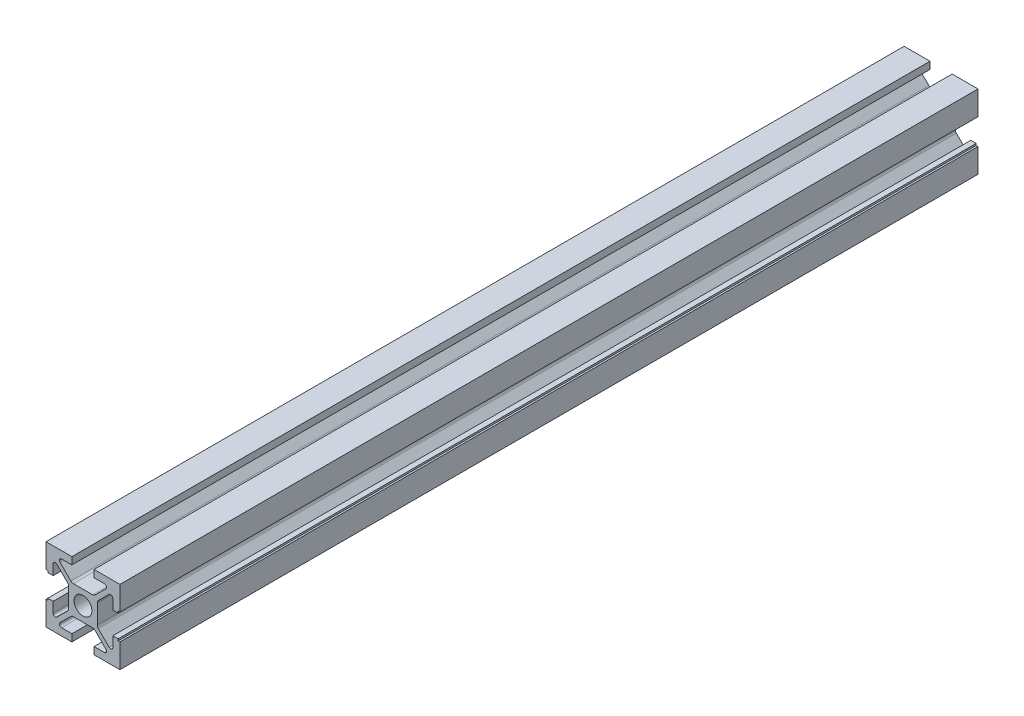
ISO-10303-21;
HEADER;
FILE_DESCRIPTION(('STEP AP214'),'2;1');
FILE_NAME('part.step','',(''),(''),'','','');
FILE_SCHEMA(('AUTOMOTIVE_DESIGN { 1 0 10303 214 1 1 1 1 }'));
ENDSEC;
DATA;
#1=APPLICATION_CONTEXT('core data for automotive mechanical design processes');
#2=APPLICATION_PROTOCOL_DEFINITION('international standard','automotive_design',2000,#1);
#3=PRODUCT_CONTEXT('',#1,'mechanical');
#4=PRODUCT('Part','Part','',(#3));
#5=PRODUCT_RELATED_PRODUCT_CATEGORY('part','',(#4));
#6=PRODUCT_DEFINITION_FORMATION('','',#4);
#7=PRODUCT_DEFINITION_CONTEXT('part definition',#1,'design');
#8=PRODUCT_DEFINITION('design','',#6,#7);
#9=PRODUCT_DEFINITION_SHAPE('','',#8);
#10=(LENGTH_UNIT() NAMED_UNIT(*) SI_UNIT(.MILLI.,.METRE.));
#11=(NAMED_UNIT(*) PLANE_ANGLE_UNIT() SI_UNIT($,.RADIAN.));
#12=(NAMED_UNIT(*) SI_UNIT($,.STERADIAN.) SOLID_ANGLE_UNIT());
#13=UNCERTAINTY_MEASURE_WITH_UNIT(LENGTH_MEASURE(1.E-05),#10,'distance_accuracy_value','');
#14=(GEOMETRIC_REPRESENTATION_CONTEXT(3) GLOBAL_UNCERTAINTY_ASSIGNED_CONTEXT((#13)) GLOBAL_UNIT_ASSIGNED_CONTEXT((#10,
#11,#12)) REPRESENTATION_CONTEXT('',''));
#15=CARTESIAN_POINT('',(0.,0.,0.));
#16=DIRECTION('',(0.,0.,1.));
#17=DIRECTION('',(1.,0.,0.));
#18=AXIS2_PLACEMENT_3D('',#15,#16,#17);
#19=CARTESIAN_POINT('',(-4.,0.,240.));
#20=DIRECTION('',(-1.,0.,0.));
#21=DIRECTION('',(0.,0.,1.));
#22=AXIS2_PLACEMENT_3D('',#19,#20,#21);
#23=PLANE('',#22);
#24=DIRECTION('',(0.,1.,0.));
#25=VECTOR('',#24,1.);
#26=CARTESIAN_POINT('',(-4.,0.,0.));
#27=LINE('',#26,#25);
#28=CARTESIAN_POINT('',(-4.,-2.6860000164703,0.));
#29=VERTEX_POINT('',#28);
#30=CARTESIAN_POINT('',(-4.,2.6860000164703,0.));
#31=VERTEX_POINT('',#30);
#32=EDGE_CURVE('E451',#29,#31,#27,.T.);
#33=ORIENTED_EDGE('',*,*,#32,.F.);
#34=DIRECTION('',(0.,0.,-1.));
#35=VECTOR('',#34,1.);
#36=CARTESIAN_POINT('',(-4.,-2.6860000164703,240.));
#37=LINE('',#36,#35);
#38=CARTESIAN_POINT('',(-4.,-2.6860000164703,240.));
#39=VERTEX_POINT('',#38);
#40=EDGE_CURVE('E11',#39,#29,#37,.T.);
#41=ORIENTED_EDGE('',*,*,#40,.F.);
#42=DIRECTION('',(0.,1.,0.));
#43=VECTOR('',#42,1.);
#44=CARTESIAN_POINT('',(-4.,0.,240.));
#45=LINE('',#44,#43);
#46=CARTESIAN_POINT('',(-4.,2.6860000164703,240.));
#47=VERTEX_POINT('',#46);
#48=EDGE_CURVE('E621',#39,#47,#45,.T.);
#49=ORIENTED_EDGE('',*,*,#48,.T.);
#50=DIRECTION('',(0.,0.,-1.));
#51=VECTOR('',#50,1.);
#52=CARTESIAN_POINT('',(-4.,2.6860000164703,240.));
#53=LINE('',#52,#51);
#54=EDGE_CURVE('E247',#47,#31,#53,.T.);
#55=ORIENTED_EDGE('',*,*,#54,.T.);
#56=EDGE_LOOP('',(#33,#41,#49,#55));
#57=FACE_BOUND('',#56,.T.);
#58=ADVANCED_FACE('F41',(#57),#23,.T.);
#59=CARTESIAN_POINT('',(-5.,-2.68600001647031,240.));
#60=DIRECTION('',(0.,0.,-1.));
#61=DIRECTION('',(-1.,0.,0.));
#62=AXIS2_PLACEMENT_3D('',#59,#60,#61);
#63=CYLINDRICAL_SURFACE('',#62,1.);
#64=CARTESIAN_POINT('',(-5.,-2.68600001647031,0.));
#65=DIRECTION('',(0.,0.,1.));
#66=DIRECTION('',(1.,0.,0.));
#67=AXIS2_PLACEMENT_3D('',#64,#65,#66);
#68=CIRCLE('',#67,1.);
#69=CARTESIAN_POINT('',(-4.29263543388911,-3.3928489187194,0.));
#70=VERTEX_POINT('',#69);
#71=EDGE_CURVE('E454',#29,#70,#68,.F.);
#72=ORIENTED_EDGE('',*,*,#71,.T.);
#73=DIRECTION('',(0.,0.,-1.));
#74=VECTOR('',#73,1.);
#75=CARTESIAN_POINT('',(-4.29263543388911,-3.3928489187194,240.));
#76=LINE('',#75,#74);
#77=CARTESIAN_POINT('',(-4.29263543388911,-3.3928489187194,240.));
#78=VERTEX_POINT('',#77);
#79=EDGE_CURVE('E49',#78,#70,#76,.T.);
#80=ORIENTED_EDGE('',*,*,#79,.F.);
#81=CARTESIAN_POINT('',(-5.,-2.68600001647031,240.));
#82=DIRECTION('',(0.,0.,1.));
#83=DIRECTION('',(1.,0.,0.));
#84=AXIS2_PLACEMENT_3D('',#81,#82,#83);
#85=CIRCLE('',#84,1.);
#86=EDGE_CURVE('E906',#39,#78,#85,.F.);
#87=ORIENTED_EDGE('',*,*,#86,.F.);
#88=ORIENTED_EDGE('',*,*,#40,.T.);
#89=EDGE_LOOP('',(#72,#80,#87,#88));
#90=FACE_BOUND('',#89,.T.);
#91=ADVANCED_FACE('F749',(#90),#63,.F.);
#92=CARTESIAN_POINT('',(-0.4514589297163,0.451129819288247,240.));
#93=DIRECTION('',(-0.707364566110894,0.706848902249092,0.));
#94=DIRECTION('',(-0.706848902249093,-0.707364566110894,0.));
#95=AXIS2_PLACEMENT_3D('',#92,#93,#94);
#96=PLANE('',#95);
#97=DIRECTION('',(0.706848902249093,0.707364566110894,0.));
#98=VECTOR('',#97,1.);
#99=CARTESIAN_POINT('',(-0.4514589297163,0.451129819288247,0.));
#100=LINE('',#99,#98);
#101=CARTESIAN_POINT('',(-7.31182815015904,-6.41424421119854,0.));
#102=VERTEX_POINT('',#101);
#103=EDGE_CURVE('E457',#102,#70,#100,.T.);
#104=ORIENTED_EDGE('',*,*,#103,.F.);
#105=DIRECTION('',(0.,0.,-1.));
#106=VECTOR('',#105,1.);
#107=CARTESIAN_POINT('',(-7.31182815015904,-6.41424421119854,240.));
#108=LINE('',#107,#106);
#109=CARTESIAN_POINT('',(-7.31182815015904,-6.41424421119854,240.));
#110=VERTEX_POINT('',#109);
#111=EDGE_CURVE('E739',#110,#102,#108,.T.);
#112=ORIENTED_EDGE('',*,*,#111,.F.);
#113=DIRECTION('',(0.706848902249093,0.707364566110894,0.));
#114=VECTOR('',#113,1.);
#115=CARTESIAN_POINT('',(-0.4514589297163,0.451129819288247,240.));
#116=LINE('',#115,#114);
#117=EDGE_CURVE('E746',#110,#78,#116,.T.);
#118=ORIENTED_EDGE('',*,*,#117,.T.);
#119=ORIENTED_EDGE('',*,*,#79,.T.);
#120=EDGE_LOOP('',(#104,#112,#118,#119));
#121=FACE_BOUND('',#120,.T.);
#122=ADVANCED_FACE('F744',(#121),#96,.T.);
#123=CARTESIAN_POINT('',(-7.73624688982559,-5.99013486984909,240.));
#124=DIRECTION('',(0.,0.,-1.));
#125=DIRECTION('',(-1.,0.,0.));
#126=AXIS2_PLACEMENT_3D('',#123,#124,#125);
#127=CYLINDRICAL_SURFACE('',#126,0.6);
#128=CARTESIAN_POINT('',(-7.73624688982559,-5.99013486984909,0.));
#129=DIRECTION('',(0.,0.,1.));
#130=DIRECTION('',(1.,0.,0.));
#131=AXIS2_PLACEMENT_3D('',#128,#129,#130);
#132=CIRCLE('',#131,0.6);
#133=CARTESIAN_POINT('',(-8.33624688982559,-5.99013486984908,0.));
#134=VERTEX_POINT('',#133);
#135=EDGE_CURVE('E460',#102,#134,#132,.F.);
#136=ORIENTED_EDGE('',*,*,#135,.T.);
#137=DIRECTION('',(0.,0.,-1.));
#138=VECTOR('',#137,1.);
#139=CARTESIAN_POINT('',(-8.33624688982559,-5.99013486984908,240.));
#140=LINE('',#139,#138);
#141=CARTESIAN_POINT('',(-8.33624688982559,-5.99013486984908,240.));
#142=VERTEX_POINT('',#141);
#143=EDGE_CURVE('E736',#142,#134,#140,.T.);
#144=ORIENTED_EDGE('',*,*,#143,.F.);
#145=CARTESIAN_POINT('',(-7.73624688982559,-5.99013486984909,240.));
#146=DIRECTION('',(0.,0.,1.));
#147=DIRECTION('',(1.,0.,0.));
#148=AXIS2_PLACEMENT_3D('',#145,#146,#147);
#149=CIRCLE('',#148,0.6);
#150=EDGE_CURVE('E767',#110,#142,#149,.F.);
#151=ORIENTED_EDGE('',*,*,#150,.F.);
#152=ORIENTED_EDGE('',*,*,#111,.T.);
#153=EDGE_LOOP('',(#136,#144,#151,#152));
#154=FACE_BOUND('',#153,.T.);
#155=ADVANCED_FACE('F757',(#154),#127,.F.);
#156=CARTESIAN_POINT('',(-8.33624688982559,0.,240.));
#157=DIRECTION('',(-1.,0.,0.));
#158=DIRECTION('',(0.,-1.,0.));
#159=AXIS2_PLACEMENT_3D('',#156,#157,#158);
#160=PLANE('',#159);
#161=DIRECTION('',(0.,1.,0.));
#162=VECTOR('',#161,1.);
#163=CARTESIAN_POINT('',(-8.33624688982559,0.,0.));
#164=LINE('',#163,#162);
#165=CARTESIAN_POINT('',(-8.33624688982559,-3.10000000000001,0.));
#166=VERTEX_POINT('',#165);
#167=EDGE_CURVE('E462',#134,#166,#164,.T.);
#168=ORIENTED_EDGE('',*,*,#167,.T.);
#169=DIRECTION('',(0.,0.,-1.));
#170=VECTOR('',#169,1.);
#171=CARTESIAN_POINT('',(-8.33624688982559,-3.10000000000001,240.));
#172=LINE('',#171,#170);
#173=CARTESIAN_POINT('',(-8.33624688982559,-3.10000000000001,240.));
#174=VERTEX_POINT('',#173);
#175=EDGE_CURVE('E734',#174,#166,#172,.T.);
#176=ORIENTED_EDGE('',*,*,#175,.F.);
#177=DIRECTION('',(0.,1.,0.));
#178=VECTOR('',#177,1.);
#179=CARTESIAN_POINT('',(-8.33624688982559,0.,240.));
#180=LINE('',#179,#178);
#181=EDGE_CURVE('E763',#142,#174,#180,.T.);
#182=ORIENTED_EDGE('',*,*,#181,.F.);
#183=ORIENTED_EDGE('',*,*,#143,.T.);
#184=EDGE_LOOP('',(#168,#176,#182,#183));
#185=FACE_BOUND('',#184,.T.);
#186=ADVANCED_FACE('F761',(#185),#160,.F.);
#187=CARTESIAN_POINT('',(0.,-3.10000000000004,240.));
#188=DIRECTION('',(0.,1.,0.));
#189=DIRECTION('',(-1.,0.,0.));
#190=AXIS2_PLACEMENT_3D('',#187,#188,#189);
#191=PLANE('',#190);
#192=DIRECTION('',(1.,0.,0.));
#193=VECTOR('',#192,1.);
#194=CARTESIAN_POINT('',(0.,-3.10000000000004,0.));
#195=LINE('',#194,#193);
#196=CARTESIAN_POINT('',(-9.83624688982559,-3.1,0.));
#197=VERTEX_POINT('',#196);
#198=EDGE_CURVE('E465',#197,#166,#195,.T.);
#199=ORIENTED_EDGE('',*,*,#198,.F.);
#200=DIRECTION('',(0.,0.,-1.));
#201=VECTOR('',#200,1.);
#202=CARTESIAN_POINT('',(-9.83624688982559,-3.1,240.));
#203=LINE('',#202,#201);
#204=CARTESIAN_POINT('',(-9.83624688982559,-3.1,240.));
#205=VERTEX_POINT('',#204);
#206=EDGE_CURVE('E732',#205,#197,#203,.T.);
#207=ORIENTED_EDGE('',*,*,#206,.F.);
#208=DIRECTION('',(1.,0.,0.));
#209=VECTOR('',#208,1.);
#210=CARTESIAN_POINT('',(0.,-3.10000000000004,240.));
#211=LINE('',#210,#209);
#212=EDGE_CURVE('E766',#205,#174,#211,.T.);
#213=ORIENTED_EDGE('',*,*,#212,.T.);
#214=ORIENTED_EDGE('',*,*,#175,.T.);
#215=EDGE_LOOP('',(#199,#207,#213,#214));
#216=FACE_BOUND('',#215,.T.);
#217=ADVANCED_FACE('F922',(#216),#191,.T.);
#218=CARTESIAN_POINT('',(-9.83624688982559,0.,240.));
#219=DIRECTION('',(1.,0.,0.));
#220=DIRECTION('',(0.,0.,-1.));
#221=AXIS2_PLACEMENT_3D('',#218,#219,#220);
#222=PLANE('',#221);
#223=DIRECTION('',(0.,-1.,0.));
#224=VECTOR('',#223,1.);
#225=CARTESIAN_POINT('',(-9.83624688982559,0.,0.));
#226=LINE('',#225,#224);
#227=CARTESIAN_POINT('',(-9.83624688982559,-3.6,0.));
#228=VERTEX_POINT('',#227);
#229=EDGE_CURVE('E468',#197,#228,#226,.T.);
#230=ORIENTED_EDGE('',*,*,#229,.T.);
#231=DIRECTION('',(0.,0.,-1.));
#232=VECTOR('',#231,1.);
#233=CARTESIAN_POINT('',(-9.83624688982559,-3.6,240.));
#234=LINE('',#233,#232);
#235=CARTESIAN_POINT('',(-9.83624688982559,-3.6,240.));
#236=VERTEX_POINT('',#235);
#237=EDGE_CURVE('E730',#236,#228,#234,.T.);
#238=ORIENTED_EDGE('',*,*,#237,.F.);
#239=DIRECTION('',(0.,-1.,0.));
#240=VECTOR('',#239,1.);
#241=CARTESIAN_POINT('',(-9.83624688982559,0.,240.));
#242=LINE('',#241,#240);
#243=EDGE_CURVE('E769',#205,#236,#242,.T.);
#244=ORIENTED_EDGE('',*,*,#243,.F.);
#245=ORIENTED_EDGE('',*,*,#206,.T.);
#246=EDGE_LOOP('',(#230,#238,#244,#245));
#247=FACE_BOUND('',#246,.T.);
#248=ADVANCED_FACE('F925',(#247),#222,.F.);
#249=CARTESIAN_POINT('',(0.,-3.6,240.));
#250=DIRECTION('',(0.,1.,0.));
#251=DIRECTION('',(0.,0.,1.));
#252=AXIS2_PLACEMENT_3D('',#249,#250,#251);
#253=PLANE('',#252);
#254=DIRECTION('',(1.,0.,0.));
#255=VECTOR('',#254,1.);
#256=CARTESIAN_POINT('',(0.,-3.6,0.));
#257=LINE('',#256,#255);
#258=CARTESIAN_POINT('',(-10.3362468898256,-3.6,0.));
#259=VERTEX_POINT('',#258);
#260=EDGE_CURVE('E471',#259,#228,#257,.T.);
#261=ORIENTED_EDGE('',*,*,#260,.F.);
#262=DIRECTION('',(0.,0.,-1.));
#263=VECTOR('',#262,1.);
#264=CARTESIAN_POINT('',(-10.3362468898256,-3.6,240.));
#265=LINE('',#264,#263);
#266=CARTESIAN_POINT('',(-10.3362468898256,-3.6,240.));
#267=VERTEX_POINT('',#266);
#268=EDGE_CURVE('E728',#267,#259,#265,.T.);
#269=ORIENTED_EDGE('',*,*,#268,.F.);
#270=DIRECTION('',(1.,0.,0.));
#271=VECTOR('',#270,1.);
#272=CARTESIAN_POINT('',(0.,-3.6,240.));
#273=LINE('',#272,#271);
#274=EDGE_CURVE('E775',#267,#236,#273,.T.);
#275=ORIENTED_EDGE('',*,*,#274,.T.);
#276=ORIENTED_EDGE('',*,*,#237,.T.);
#277=EDGE_LOOP('',(#261,#269,#275,#276));
#278=FACE_BOUND('',#277,.T.);
#279=ADVANCED_FACE('F929',(#278),#253,.T.);
#280=CARTESIAN_POINT('',(-10.3362468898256,0.,240.));
#281=DIRECTION('',(-1.,0.,0.));
#282=DIRECTION('',(0.,0.,1.));
#283=AXIS2_PLACEMENT_3D('',#280,#281,#282);
#284=PLANE('',#283);
#285=DIRECTION('',(0.,1.,0.));
#286=VECTOR('',#285,1.);
#287=CARTESIAN_POINT('',(-10.3362468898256,0.,0.));
#288=LINE('',#287,#286);
#289=CARTESIAN_POINT('',(-10.3362468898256,-10.3362468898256,0.));
#290=VERTEX_POINT('',#289);
#291=EDGE_CURVE('E474',#290,#259,#288,.T.);
#292=ORIENTED_EDGE('',*,*,#291,.F.);
#293=DIRECTION('',(0.,0.,-1.));
#294=VECTOR('',#293,1.);
#295=CARTESIAN_POINT('',(-10.3362468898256,-10.3362468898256,240.));
#296=LINE('',#295,#294);
#297=CARTESIAN_POINT('',(-10.3362468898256,-10.3362468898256,240.));
#298=VERTEX_POINT('',#297);
#299=EDGE_CURVE('E726',#298,#290,#296,.T.);
#300=ORIENTED_EDGE('',*,*,#299,.F.);
#301=DIRECTION('',(0.,1.,0.));
#302=VECTOR('',#301,1.);
#303=CARTESIAN_POINT('',(-10.3362468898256,0.,240.));
#304=LINE('',#303,#302);
#305=EDGE_CURVE('E778',#298,#267,#304,.T.);
#306=ORIENTED_EDGE('',*,*,#305,.T.);
#307=ORIENTED_EDGE('',*,*,#268,.T.);
#308=EDGE_LOOP('',(#292,#300,#306,#307));
#309=FACE_BOUND('',#308,.T.);
#310=ADVANCED_FACE('F933',(#309),#284,.T.);
#311=CARTESIAN_POINT('',(0.,-10.3362468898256,240.));
#312=DIRECTION('',(0.,1.,0.));
#313=DIRECTION('',(0.,0.,1.));
#314=AXIS2_PLACEMENT_3D('',#311,#312,#313);
#315=PLANE('',#314);
#316=DIRECTION('',(1.,0.,0.));
#317=VECTOR('',#316,1.);
#318=CARTESIAN_POINT('',(0.,-10.3362468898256,0.));
#319=LINE('',#318,#317);
#320=CARTESIAN_POINT('',(-3.1,-10.3362468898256,0.));
#321=VERTEX_POINT('',#320);
#322=EDGE_CURVE('E477',#290,#321,#319,.T.);
#323=ORIENTED_EDGE('',*,*,#322,.T.);
#324=DIRECTION('',(0.,0.,-1.));
#325=VECTOR('',#324,1.);
#326=CARTESIAN_POINT('',(-3.1,-10.3362468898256,240.));
#327=LINE('',#326,#325);
#328=CARTESIAN_POINT('',(-3.1,-10.3362468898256,240.));
#329=VERTEX_POINT('',#328);
#330=EDGE_CURVE('E723',#329,#321,#327,.T.);
#331=ORIENTED_EDGE('',*,*,#330,.F.);
#332=DIRECTION('',(1.,0.,0.));
#333=VECTOR('',#332,1.);
#334=CARTESIAN_POINT('',(0.,-10.3362468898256,240.));
#335=LINE('',#334,#333);
#336=EDGE_CURVE('E781',#298,#329,#335,.T.);
#337=ORIENTED_EDGE('',*,*,#336,.F.);
#338=ORIENTED_EDGE('',*,*,#299,.T.);
#339=EDGE_LOOP('',(#323,#331,#337,#338));
#340=FACE_BOUND('',#339,.T.);
#341=ADVANCED_FACE('F937',(#340),#315,.F.);
#342=CARTESIAN_POINT('',(-3.09999999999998,0.,240.));
#343=DIRECTION('',(-1.,0.,0.));
#344=DIRECTION('',(0.,-1.,0.));
#345=AXIS2_PLACEMENT_3D('',#342,#343,#344);
#346=PLANE('',#345);
#347=DIRECTION('',(0.,1.,0.));
#348=VECTOR('',#347,1.);
#349=CARTESIAN_POINT('',(-3.09999999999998,0.,0.));
#350=LINE('',#349,#348);
#351=CARTESIAN_POINT('',(-3.1,-8.33624688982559,0.));
#352=VERTEX_POINT('',#351);
#353=EDGE_CURVE('E479',#321,#352,#350,.T.);
#354=ORIENTED_EDGE('',*,*,#353,.T.);
#355=DIRECTION('',(0.,0.,-1.));
#356=VECTOR('',#355,1.);
#357=CARTESIAN_POINT('',(-3.1,-8.33624688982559,240.));
#358=LINE('',#357,#356);
#359=CARTESIAN_POINT('',(-3.1,-8.33624688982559,240.));
#360=VERTEX_POINT('',#359);
#361=EDGE_CURVE('E721',#360,#352,#358,.T.);
#362=ORIENTED_EDGE('',*,*,#361,.F.);
#363=DIRECTION('',(0.,1.,0.));
#364=VECTOR('',#363,1.);
#365=CARTESIAN_POINT('',(-3.09999999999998,0.,240.));
#366=LINE('',#365,#364);
#367=EDGE_CURVE('E783',#329,#360,#366,.T.);
#368=ORIENTED_EDGE('',*,*,#367,.F.);
#369=ORIENTED_EDGE('',*,*,#330,.T.);
#370=EDGE_LOOP('',(#354,#362,#368,#369));
#371=FACE_BOUND('',#370,.T.);
#372=ADVANCED_FACE('F941',(#371),#346,.F.);
#373=CARTESIAN_POINT('',(0.,-8.33624688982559,240.));
#374=DIRECTION('',(0.,1.,0.));
#375=DIRECTION('',(0.,0.,1.));
#376=AXIS2_PLACEMENT_3D('',#373,#374,#375);
#377=PLANE('',#376);
#378=DIRECTION('',(1.,0.,0.));
#379=VECTOR('',#378,1.);
#380=CARTESIAN_POINT('',(0.,-8.33624688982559,0.));
#381=LINE('',#380,#379);
#382=CARTESIAN_POINT('',(-5.99076413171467,-8.33624688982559,0.));
#383=VERTEX_POINT('',#382);
#384=EDGE_CURVE('E482',#383,#352,#381,.T.);
#385=ORIENTED_EDGE('',*,*,#384,.F.);
#386=DIRECTION('',(0.,0.,-1.));
#387=VECTOR('',#386,1.);
#388=CARTESIAN_POINT('',(-5.99076413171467,-8.33624688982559,240.));
#389=LINE('',#388,#387);
#390=CARTESIAN_POINT('',(-5.99076413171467,-8.33624688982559,240.));
#391=VERTEX_POINT('',#390);
#392=EDGE_CURVE('E719',#391,#383,#389,.T.);
#393=ORIENTED_EDGE('',*,*,#392,.F.);
#394=DIRECTION('',(1.,0.,0.));
#395=VECTOR('',#394,1.);
#396=CARTESIAN_POINT('',(0.,-8.33624688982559,240.));
#397=LINE('',#396,#395);
#398=EDGE_CURVE('E785',#391,#360,#397,.T.);
#399=ORIENTED_EDGE('',*,*,#398,.T.);
#400=ORIENTED_EDGE('',*,*,#361,.T.);
#401=EDGE_LOOP('',(#385,#393,#399,#400));
#402=FACE_BOUND('',#401,.T.);
#403=ADVANCED_FACE('F945',(#402),#377,.T.);
#404=CARTESIAN_POINT('',(-5.99076413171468,-7.7362468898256,240.));
#405=DIRECTION('',(0.,0.,-1.));
#406=DIRECTION('',(-1.,0.,0.));
#407=AXIS2_PLACEMENT_3D('',#404,#405,#406);
#408=CYLINDRICAL_SURFACE('',#407,0.599999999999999);
#409=CARTESIAN_POINT('',(-5.99076413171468,-7.7362468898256,0.));
#410=DIRECTION('',(0.,0.,1.));
#411=DIRECTION('',(1.,0.,0.));
#412=AXIS2_PLACEMENT_3D('',#409,#410,#411);
#413=CIRCLE('',#412,0.599999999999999);
#414=CARTESIAN_POINT('',(-6.41483318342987,-7.31178789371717,0.));
#415=VERTEX_POINT('',#414);
#416=EDGE_CURVE('E485',#383,#415,#413,.F.);
#417=ORIENTED_EDGE('',*,*,#416,.T.);
#418=DIRECTION('',(0.,0.,-1.));
#419=VECTOR('',#418,1.);
#420=CARTESIAN_POINT('',(-6.41483318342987,-7.31178789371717,240.));
#421=LINE('',#420,#419);
#422=CARTESIAN_POINT('',(-6.41483318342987,-7.31178789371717,240.));
#423=VERTEX_POINT('',#422);
#424=EDGE_CURVE('E717',#423,#415,#421,.T.);
#425=ORIENTED_EDGE('',*,*,#424,.F.);
#426=CARTESIAN_POINT('',(-5.99076413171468,-7.7362468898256,240.));
#427=DIRECTION('',(0.,0.,1.));
#428=DIRECTION('',(1.,0.,0.));
#429=AXIS2_PLACEMENT_3D('',#426,#427,#428);
#430=CIRCLE('',#429,0.599999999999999);
#431=EDGE_CURVE('E788',#391,#423,#430,.F.);
#432=ORIENTED_EDGE('',*,*,#431,.F.);
#433=ORIENTED_EDGE('',*,*,#392,.T.);
#434=EDGE_LOOP('',(#417,#425,#432,#433));
#435=FACE_BOUND('',#434,.T.);
#436=ADVANCED_FACE('F949',(#435),#408,.F.);
#437=CARTESIAN_POINT('',(0.451423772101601,-0.451838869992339,240.));
#438=DIRECTION('',(0.706781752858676,-0.707431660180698,0.));
#439=DIRECTION('',(0.707431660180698,0.706781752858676,0.));
#440=AXIS2_PLACEMENT_3D('',#437,#438,#439);
#441=PLANE('',#440);
#442=DIRECTION('',(-0.707431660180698,-0.706781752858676,0.));
#443=VECTOR('',#442,1.);
#444=CARTESIAN_POINT('',(0.451423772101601,-0.451838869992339,0.));
#445=LINE('',#444,#443);
#446=CARTESIAN_POINT('',(-3.39283736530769,-4.29256833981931,0.));
#447=VERTEX_POINT('',#446);
#448=EDGE_CURVE('E488',#447,#415,#445,.T.);
#449=ORIENTED_EDGE('',*,*,#448,.F.);
#450=DIRECTION('',(0.,0.,-1.));
#451=VECTOR('',#450,1.);
#452=CARTESIAN_POINT('',(-3.39283736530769,-4.29256833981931,240.));
#453=LINE('',#452,#451);
#454=CARTESIAN_POINT('',(-3.39283736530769,-4.29256833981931,240.));
#455=VERTEX_POINT('',#454);
#456=EDGE_CURVE('E715',#455,#447,#453,.T.);
#457=ORIENTED_EDGE('',*,*,#456,.F.);
#458=DIRECTION('',(-0.707431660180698,-0.706781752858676,0.));
#459=VECTOR('',#458,1.);
#460=CARTESIAN_POINT('',(0.451423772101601,-0.451838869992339,240.));
#461=LINE('',#460,#459);
#462=EDGE_CURVE('E790',#455,#423,#461,.T.);
#463=ORIENTED_EDGE('',*,*,#462,.T.);
#464=ORIENTED_EDGE('',*,*,#424,.T.);
#465=EDGE_LOOP('',(#449,#457,#463,#464));
#466=FACE_BOUND('',#465,.T.);
#467=ADVANCED_FACE('F953',(#466),#441,.T.);
#468=CARTESIAN_POINT('',(-2.68605561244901,-5.,240.));
#469=DIRECTION('',(0.,0.,-1.));
#470=DIRECTION('',(-1.,0.,0.));
#471=AXIS2_PLACEMENT_3D('',#468,#469,#470);
#472=CYLINDRICAL_SURFACE('',#471,1.);
#473=CARTESIAN_POINT('',(-2.68605561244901,-5.,0.));
#474=DIRECTION('',(0.,0.,1.));
#475=DIRECTION('',(1.,0.,0.));
#476=AXIS2_PLACEMENT_3D('',#473,#474,#475);
#477=CIRCLE('',#476,1.);
#478=CARTESIAN_POINT('',(-2.686055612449,-4.,0.));
#479=VERTEX_POINT('',#478);
#480=EDGE_CURVE('E491',#479,#447,#477,.T.);
#481=ORIENTED_EDGE('',*,*,#480,.F.);
#482=DIRECTION('',(0.,0.,-1.));
#483=VECTOR('',#482,1.);
#484=CARTESIAN_POINT('',(-2.686055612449,-4.,240.));
#485=LINE('',#484,#483);
#486=CARTESIAN_POINT('',(-2.686055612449,-4.,240.));
#487=VERTEX_POINT('',#486);
#488=EDGE_CURVE('E713',#487,#479,#485,.T.);
#489=ORIENTED_EDGE('',*,*,#488,.F.);
#490=CARTESIAN_POINT('',(-2.68605561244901,-5.,240.));
#491=DIRECTION('',(0.,0.,1.));
#492=DIRECTION('',(1.,0.,0.));
#493=AXIS2_PLACEMENT_3D('',#490,#491,#492);
#494=CIRCLE('',#493,1.);
#495=EDGE_CURVE('E793',#487,#455,#494,.T.);
#496=ORIENTED_EDGE('',*,*,#495,.T.);
#497=ORIENTED_EDGE('',*,*,#456,.T.);
#498=EDGE_LOOP('',(#481,#489,#496,#497));
#499=FACE_BOUND('',#498,.T.);
#500=ADVANCED_FACE('F957',(#499),#472,.F.);
#501=CARTESIAN_POINT('',(0.,-4.,240.));
#502=DIRECTION('',(0.,1.,0.));
#503=DIRECTION('',(0.,0.,1.));
#504=AXIS2_PLACEMENT_3D('',#501,#502,#503);
#505=PLANE('',#504);
#506=DIRECTION('',(1.,0.,0.));
#507=VECTOR('',#506,1.);
#508=CARTESIAN_POINT('',(0.,-4.,0.));
#509=LINE('',#508,#507);
#510=CARTESIAN_POINT('',(2.686055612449,-4.,0.));
#511=VERTEX_POINT('',#510);
#512=EDGE_CURVE('E494',#479,#511,#509,.T.);
#513=ORIENTED_EDGE('',*,*,#512,.T.);
#514=DIRECTION('',(0.,0.,-1.));
#515=VECTOR('',#514,1.);
#516=CARTESIAN_POINT('',(2.686055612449,-4.,240.));
#517=LINE('',#516,#515);
#518=CARTESIAN_POINT('',(2.686055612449,-4.,240.));
#519=VERTEX_POINT('',#518);
#520=EDGE_CURVE('E711',#519,#511,#517,.T.);
#521=ORIENTED_EDGE('',*,*,#520,.F.);
#522=DIRECTION('',(1.,0.,0.));
#523=VECTOR('',#522,1.);
#524=CARTESIAN_POINT('',(0.,-4.,240.));
#525=LINE('',#524,#523);
#526=EDGE_CURVE('E796',#487,#519,#525,.T.);
#527=ORIENTED_EDGE('',*,*,#526,.F.);
#528=ORIENTED_EDGE('',*,*,#488,.T.);
#529=EDGE_LOOP('',(#513,#521,#527,#528));
#530=FACE_BOUND('',#529,.T.);
#531=ADVANCED_FACE('F961',(#530),#505,.F.);
#532=CARTESIAN_POINT('',(2.68605561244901,-5.,240.));
#533=DIRECTION('',(0.,0.,-1.));
#534=DIRECTION('',(-1.,0.,0.));
#535=AXIS2_PLACEMENT_3D('',#532,#533,#534);
#536=CYLINDRICAL_SURFACE('',#535,1.);
#537=CARTESIAN_POINT('',(2.68605561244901,-5.,0.));
#538=DIRECTION('',(0.,0.,1.));
#539=DIRECTION('',(1.,0.,0.));
#540=AXIS2_PLACEMENT_3D('',#537,#538,#539);
#541=CIRCLE('',#540,1.);
#542=CARTESIAN_POINT('',(3.39283736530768,-4.29256833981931,0.));
#543=VERTEX_POINT('',#542);
#544=EDGE_CURVE('E497',#543,#511,#541,.T.);
#545=ORIENTED_EDGE('',*,*,#544,.F.);
#546=DIRECTION('',(0.,0.,-1.));
#547=VECTOR('',#546,1.);
#548=CARTESIAN_POINT('',(3.39283736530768,-4.29256833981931,240.));
#549=LINE('',#548,#547);
#550=CARTESIAN_POINT('',(3.39283736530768,-4.29256833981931,240.));
#551=VERTEX_POINT('',#550);
#552=EDGE_CURVE('E709',#551,#543,#549,.T.);
#553=ORIENTED_EDGE('',*,*,#552,.F.);
#554=CARTESIAN_POINT('',(2.68605561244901,-5.,240.));
#555=DIRECTION('',(0.,0.,1.));
#556=DIRECTION('',(1.,0.,0.));
#557=AXIS2_PLACEMENT_3D('',#554,#555,#556);
#558=CIRCLE('',#557,1.);
#559=EDGE_CURVE('E798',#551,#519,#558,.T.);
#560=ORIENTED_EDGE('',*,*,#559,.T.);
#561=ORIENTED_EDGE('',*,*,#520,.T.);
#562=EDGE_LOOP('',(#545,#553,#560,#561));
#563=FACE_BOUND('',#562,.T.);
#564=ADVANCED_FACE('F965',(#563),#536,.F.);
#565=CARTESIAN_POINT('',(-0.451423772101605,-0.451838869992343,240.));
#566=DIRECTION('',(0.706781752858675,0.707431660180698,0.));
#567=DIRECTION('',(-0.707431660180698,0.706781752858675,0.));
#568=AXIS2_PLACEMENT_3D('',#565,#566,#567);
#569=PLANE('',#568);
#570=DIRECTION('',(0.707431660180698,-0.706781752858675,0.));
#571=VECTOR('',#570,1.);
#572=CARTESIAN_POINT('',(-0.451423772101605,-0.451838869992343,0.));
#573=LINE('',#572,#571);
#574=CARTESIAN_POINT('',(6.41483318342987,-7.31178789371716,0.));
#575=VERTEX_POINT('',#574);
#576=EDGE_CURVE('E500',#543,#575,#573,.T.);
#577=ORIENTED_EDGE('',*,*,#576,.T.);
#578=DIRECTION('',(0.,0.,-1.));
#579=VECTOR('',#578,1.);
#580=CARTESIAN_POINT('',(6.41483318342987,-7.31178789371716,240.));
#581=LINE('',#580,#579);
#582=CARTESIAN_POINT('',(6.41483318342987,-7.31178789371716,240.));
#583=VERTEX_POINT('',#582);
#584=EDGE_CURVE('E707',#583,#575,#581,.T.);
#585=ORIENTED_EDGE('',*,*,#584,.F.);
#586=DIRECTION('',(0.707431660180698,-0.706781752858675,0.));
#587=VECTOR('',#586,1.);
#588=CARTESIAN_POINT('',(-0.451423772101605,-0.451838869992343,240.));
#589=LINE('',#588,#587);
#590=EDGE_CURVE('E801',#551,#583,#589,.T.);
#591=ORIENTED_EDGE('',*,*,#590,.F.);
#592=ORIENTED_EDGE('',*,*,#552,.T.);
#593=EDGE_LOOP('',(#577,#585,#591,#592));
#594=FACE_BOUND('',#593,.T.);
#595=ADVANCED_FACE('F969',(#594),#569,.F.);
#596=CARTESIAN_POINT('',(5.99076413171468,-7.73624688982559,240.));
#597=DIRECTION('',(0.,0.,-1.));
#598=DIRECTION('',(-1.,0.,0.));
#599=AXIS2_PLACEMENT_3D('',#596,#597,#598);
#600=CYLINDRICAL_SURFACE('',#599,0.6);
#601=CARTESIAN_POINT('',(5.99076413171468,-7.73624688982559,0.));
#602=DIRECTION('',(0.,0.,1.));
#603=DIRECTION('',(1.,0.,0.));
#604=AXIS2_PLACEMENT_3D('',#601,#602,#603);
#605=CIRCLE('',#604,0.6);
#606=CARTESIAN_POINT('',(5.99076413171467,-8.33624688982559,0.));
#607=VERTEX_POINT('',#606);
#608=EDGE_CURVE('E503',#607,#575,#605,.T.);
#609=ORIENTED_EDGE('',*,*,#608,.F.);
#610=DIRECTION('',(0.,0.,-1.));
#611=VECTOR('',#610,1.);
#612=CARTESIAN_POINT('',(5.99076413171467,-8.33624688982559,240.));
#613=LINE('',#612,#611);
#614=CARTESIAN_POINT('',(5.99076413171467,-8.33624688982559,240.));
#615=VERTEX_POINT('',#614);
#616=EDGE_CURVE('E705',#615,#607,#613,.T.);
#617=ORIENTED_EDGE('',*,*,#616,.F.);
#618=CARTESIAN_POINT('',(5.99076413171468,-7.73624688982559,240.));
#619=DIRECTION('',(0.,0.,1.));
#620=DIRECTION('',(1.,0.,0.));
#621=AXIS2_PLACEMENT_3D('',#618,#619,#620);
#622=CIRCLE('',#621,0.6);
#623=EDGE_CURVE('E803',#615,#583,#622,.T.);
#624=ORIENTED_EDGE('',*,*,#623,.T.);
#625=ORIENTED_EDGE('',*,*,#584,.T.);
#626=EDGE_LOOP('',(#609,#617,#624,#625));
#627=FACE_BOUND('',#626,.T.);
#628=ADVANCED_FACE('F973',(#627),#600,.F.);
#629=CARTESIAN_POINT('',(0.,-8.33624688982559,240.));
#630=DIRECTION('',(0.,-1.,0.));
#631=DIRECTION('',(0.,0.,-1.));
#632=AXIS2_PLACEMENT_3D('',#629,#630,#631);
#633=PLANE('',#632);
#634=DIRECTION('',(-1.,0.,0.));
#635=VECTOR('',#634,1.);
#636=CARTESIAN_POINT('',(0.,-8.33624688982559,0.));
#637=LINE('',#636,#635);
#638=CARTESIAN_POINT('',(3.1,-8.33624688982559,0.));
#639=VERTEX_POINT('',#638);
#640=EDGE_CURVE('E506',#607,#639,#637,.T.);
#641=ORIENTED_EDGE('',*,*,#640,.T.);
#642=DIRECTION('',(0.,0.,-1.));
#643=VECTOR('',#642,1.);
#644=CARTESIAN_POINT('',(3.1,-8.33624688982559,240.));
#645=LINE('',#644,#643);
#646=CARTESIAN_POINT('',(3.1,-8.33624688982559,240.));
#647=VERTEX_POINT('',#646);
#648=EDGE_CURVE('E703',#647,#639,#645,.T.);
#649=ORIENTED_EDGE('',*,*,#648,.F.);
#650=DIRECTION('',(-1.,0.,0.));
#651=VECTOR('',#650,1.);
#652=CARTESIAN_POINT('',(0.,-8.33624688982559,240.));
#653=LINE('',#652,#651);
#654=EDGE_CURVE('E806',#615,#647,#653,.T.);
#655=ORIENTED_EDGE('',*,*,#654,.F.);
#656=ORIENTED_EDGE('',*,*,#616,.T.);
#657=EDGE_LOOP('',(#641,#649,#655,#656));
#658=FACE_BOUND('',#657,.T.);
#659=ADVANCED_FACE('F977',(#658),#633,.F.);
#660=CARTESIAN_POINT('',(3.1,0.,240.));
#661=DIRECTION('',(-1.,0.,0.));
#662=DIRECTION('',(0.,-1.,0.));
#663=AXIS2_PLACEMENT_3D('',#660,#661,#662);
#664=PLANE('',#663);
#665=DIRECTION('',(0.,1.,0.));
#666=VECTOR('',#665,1.);
#667=CARTESIAN_POINT('',(3.1,0.,0.));
#668=LINE('',#667,#666);
#669=CARTESIAN_POINT('',(3.1,-10.3362468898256,0.));
#670=VERTEX_POINT('',#669);
#671=EDGE_CURVE('E509',#670,#639,#668,.T.);
#672=ORIENTED_EDGE('',*,*,#671,.F.);
#673=DIRECTION('',(0.,0.,-1.));
#674=VECTOR('',#673,1.);
#675=CARTESIAN_POINT('',(3.1,-10.3362468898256,240.));
#676=LINE('',#675,#674);
#677=CARTESIAN_POINT('',(3.1,-10.3362468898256,240.));
#678=VERTEX_POINT('',#677);
#679=EDGE_CURVE('E701',#678,#670,#676,.T.);
#680=ORIENTED_EDGE('',*,*,#679,.F.);
#681=DIRECTION('',(0.,1.,0.));
#682=VECTOR('',#681,1.);
#683=CARTESIAN_POINT('',(3.1,0.,240.));
#684=LINE('',#683,#682);
#685=EDGE_CURVE('E808',#678,#647,#684,.T.);
#686=ORIENTED_EDGE('',*,*,#685,.T.);
#687=ORIENTED_EDGE('',*,*,#648,.T.);
#688=EDGE_LOOP('',(#672,#680,#686,#687));
#689=FACE_BOUND('',#688,.T.);
#690=ADVANCED_FACE('F981',(#689),#664,.T.);
#691=CARTESIAN_POINT('',(0.,-10.3362468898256,240.));
#692=DIRECTION('',(0.,1.,0.));
#693=DIRECTION('',(0.,0.,1.));
#694=AXIS2_PLACEMENT_3D('',#691,#692,#693);
#695=PLANE('',#694);
#696=DIRECTION('',(1.,0.,0.));
#697=VECTOR('',#696,1.);
#698=CARTESIAN_POINT('',(0.,-10.3362468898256,0.));
#699=LINE('',#698,#697);
#700=CARTESIAN_POINT('',(10.3362468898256,-10.3362468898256,0.));
#701=VERTEX_POINT('',#700);
#702=EDGE_CURVE('E512',#670,#701,#699,.T.);
#703=ORIENTED_EDGE('',*,*,#702,.T.);
#704=DIRECTION('',(0.,0.,-1.));
#705=VECTOR('',#704,1.);
#706=CARTESIAN_POINT('',(10.3362468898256,-10.3362468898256,240.));
#707=LINE('',#706,#705);
#708=CARTESIAN_POINT('',(10.3362468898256,-10.3362468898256,240.));
#709=VERTEX_POINT('',#708);
#710=EDGE_CURVE('E698',#709,#701,#707,.T.);
#711=ORIENTED_EDGE('',*,*,#710,.F.);
#712=DIRECTION('',(1.,0.,0.));
#713=VECTOR('',#712,1.);
#714=CARTESIAN_POINT('',(0.,-10.3362468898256,240.));
#715=LINE('',#714,#713);
#716=EDGE_CURVE('E811',#678,#709,#715,.T.);
#717=ORIENTED_EDGE('',*,*,#716,.F.);
#718=ORIENTED_EDGE('',*,*,#679,.T.);
#719=EDGE_LOOP('',(#703,#711,#717,#718));
#720=FACE_BOUND('',#719,.T.);
#721=ADVANCED_FACE('F985',(#720),#695,.F.);
#722=CARTESIAN_POINT('',(10.3362468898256,0.,240.));
#723=DIRECTION('',(-1.,0.,0.));
#724=DIRECTION('',(0.,0.,1.));
#725=AXIS2_PLACEMENT_3D('',#722,#723,#724);
#726=PLANE('',#725);
#727=DIRECTION('',(0.,1.,0.));
#728=VECTOR('',#727,1.);
#729=CARTESIAN_POINT('',(10.3362468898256,0.,0.));
#730=LINE('',#729,#728);
#731=CARTESIAN_POINT('',(10.3362468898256,-3.6,0.));
#732=VERTEX_POINT('',#731);
#733=EDGE_CURVE('E514',#701,#732,#730,.T.);
#734=ORIENTED_EDGE('',*,*,#733,.T.);
#735=DIRECTION('',(0.,0.,-1.));
#736=VECTOR('',#735,1.);
#737=CARTESIAN_POINT('',(10.3362468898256,-3.6,240.));
#738=LINE('',#737,#736);
#739=CARTESIAN_POINT('',(10.3362468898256,-3.6,240.));
#740=VERTEX_POINT('',#739);
#741=EDGE_CURVE('E695',#740,#732,#738,.T.);
#742=ORIENTED_EDGE('',*,*,#741,.F.);
#743=DIRECTION('',(0.,1.,0.));
#744=VECTOR('',#743,1.);
#745=CARTESIAN_POINT('',(10.3362468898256,0.,240.));
#746=LINE('',#745,#744);
#747=EDGE_CURVE('E813',#709,#740,#746,.T.);
#748=ORIENTED_EDGE('',*,*,#747,.F.);
#749=ORIENTED_EDGE('',*,*,#710,.T.);
#750=EDGE_LOOP('',(#734,#742,#748,#749));
#751=FACE_BOUND('',#750,.T.);
#752=ADVANCED_FACE('F989',(#751),#726,.F.);
#753=CARTESIAN_POINT('',(0.,-3.6,240.));
#754=DIRECTION('',(0.,-1.,0.));
#755=DIRECTION('',(0.,0.,-1.));
#756=AXIS2_PLACEMENT_3D('',#753,#754,#755);
#757=PLANE('',#756);
#758=DIRECTION('',(-1.,0.,0.));
#759=VECTOR('',#758,1.);
#760=CARTESIAN_POINT('',(0.,-3.6,0.));
#761=LINE('',#760,#759);
#762=CARTESIAN_POINT('',(9.83624688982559,-3.6,0.));
#763=VERTEX_POINT('',#762);
#764=EDGE_CURVE('E516',#732,#763,#761,.T.);
#765=ORIENTED_EDGE('',*,*,#764,.T.);
#766=DIRECTION('',(0.,0.,-1.));
#767=VECTOR('',#766,1.);
#768=CARTESIAN_POINT('',(9.83624688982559,-3.6,240.));
#769=LINE('',#768,#767);
#770=CARTESIAN_POINT('',(9.83624688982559,-3.6,240.));
#771=VERTEX_POINT('',#770);
#772=EDGE_CURVE('E693',#771,#763,#769,.T.);
#773=ORIENTED_EDGE('',*,*,#772,.F.);
#774=DIRECTION('',(-1.,0.,0.));
#775=VECTOR('',#774,1.);
#776=CARTESIAN_POINT('',(0.,-3.6,240.));
#777=LINE('',#776,#775);
#778=EDGE_CURVE('E815',#740,#771,#777,.T.);
#779=ORIENTED_EDGE('',*,*,#778,.F.);
#780=ORIENTED_EDGE('',*,*,#741,.T.);
#781=EDGE_LOOP('',(#765,#773,#779,#780));
#782=FACE_BOUND('',#781,.T.);
#783=ADVANCED_FACE('F993',(#782),#757,.F.);
#784=CARTESIAN_POINT('',(9.83624688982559,0.,240.));
#785=DIRECTION('',(1.,0.,0.));
#786=DIRECTION('',(0.,0.,-1.));
#787=AXIS2_PLACEMENT_3D('',#784,#785,#786);
#788=PLANE('',#787);
#789=DIRECTION('',(0.,-1.,0.));
#790=VECTOR('',#789,1.);
#791=CARTESIAN_POINT('',(9.83624688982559,0.,0.));
#792=LINE('',#791,#790);
#793=CARTESIAN_POINT('',(9.83624688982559,-3.1,0.));
#794=VERTEX_POINT('',#793);
#795=EDGE_CURVE('E519',#794,#763,#792,.T.);
#796=ORIENTED_EDGE('',*,*,#795,.F.);
#797=DIRECTION('',(0.,0.,-1.));
#798=VECTOR('',#797,1.);
#799=CARTESIAN_POINT('',(9.83624688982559,-3.1,240.));
#800=LINE('',#799,#798);
#801=CARTESIAN_POINT('',(9.83624688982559,-3.1,240.));
#802=VERTEX_POINT('',#801);
#803=EDGE_CURVE('E691',#802,#794,#800,.T.);
#804=ORIENTED_EDGE('',*,*,#803,.F.);
#805=DIRECTION('',(0.,-1.,0.));
#806=VECTOR('',#805,1.);
#807=CARTESIAN_POINT('',(9.83624688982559,0.,240.));
#808=LINE('',#807,#806);
#809=EDGE_CURVE('E817',#802,#771,#808,.T.);
#810=ORIENTED_EDGE('',*,*,#809,.T.);
#811=ORIENTED_EDGE('',*,*,#772,.T.);
#812=EDGE_LOOP('',(#796,#804,#810,#811));
#813=FACE_BOUND('',#812,.T.);
#814=ADVANCED_FACE('F997',(#813),#788,.T.);
#815=CARTESIAN_POINT('',(0.,-3.10000000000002,240.));
#816=DIRECTION('',(0.,-1.,0.));
#817=DIRECTION('',(1.,0.,0.));
#818=AXIS2_PLACEMENT_3D('',#815,#816,#817);
#819=PLANE('',#818);
#820=DIRECTION('',(-1.,0.,0.));
#821=VECTOR('',#820,1.);
#822=CARTESIAN_POINT('',(0.,-3.10000000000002,0.));
#823=LINE('',#822,#821);
#824=CARTESIAN_POINT('',(8.33624688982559,-3.10000000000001,0.));
#825=VERTEX_POINT('',#824);
#826=EDGE_CURVE('E522',#794,#825,#823,.T.);
#827=ORIENTED_EDGE('',*,*,#826,.T.);
#828=DIRECTION('',(0.,0.,-1.));
#829=VECTOR('',#828,1.);
#830=CARTESIAN_POINT('',(8.33624688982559,-3.10000000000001,240.));
#831=LINE('',#830,#829);
#832=CARTESIAN_POINT('',(8.33624688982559,-3.10000000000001,240.));
#833=VERTEX_POINT('',#832);
#834=EDGE_CURVE('E689',#833,#825,#831,.T.);
#835=ORIENTED_EDGE('',*,*,#834,.F.);
#836=DIRECTION('',(-1.,0.,0.));
#837=VECTOR('',#836,1.);
#838=CARTESIAN_POINT('',(0.,-3.10000000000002,240.));
#839=LINE('',#838,#837);
#840=EDGE_CURVE('E820',#802,#833,#839,.T.);
#841=ORIENTED_EDGE('',*,*,#840,.F.);
#842=ORIENTED_EDGE('',*,*,#803,.T.);
#843=EDGE_LOOP('',(#827,#835,#841,#842));
#844=FACE_BOUND('',#843,.T.);
#845=ADVANCED_FACE('F1001',(#844),#819,.F.);
#846=CARTESIAN_POINT('',(8.33624688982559,0.,240.));
#847=DIRECTION('',(-1.,0.,0.));
#848=DIRECTION('',(0.,0.,1.));
#849=AXIS2_PLACEMENT_3D('',#846,#847,#848);
#850=PLANE('',#849);
#851=DIRECTION('',(0.,1.,0.));
#852=VECTOR('',#851,1.);
#853=CARTESIAN_POINT('',(8.33624688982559,0.,0.));
#854=LINE('',#853,#852);
#855=CARTESIAN_POINT('',(8.33624688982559,-5.99013486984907,0.));
#856=VERTEX_POINT('',#855);
#857=EDGE_CURVE('E525',#856,#825,#854,.T.);
#858=ORIENTED_EDGE('',*,*,#857,.F.);
#859=DIRECTION('',(0.,0.,-1.));
#860=VECTOR('',#859,1.);
#861=CARTESIAN_POINT('',(8.33624688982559,-5.99013486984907,240.));
#862=LINE('',#861,#860);
#863=CARTESIAN_POINT('',(8.33624688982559,-5.99013486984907,240.));
#864=VERTEX_POINT('',#863);
#865=EDGE_CURVE('E687',#864,#856,#862,.T.);
#866=ORIENTED_EDGE('',*,*,#865,.F.);
#867=DIRECTION('',(0.,1.,0.));
#868=VECTOR('',#867,1.);
#869=CARTESIAN_POINT('',(8.33624688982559,0.,240.));
#870=LINE('',#869,#868);
#871=EDGE_CURVE('E822',#864,#833,#870,.T.);
#872=ORIENTED_EDGE('',*,*,#871,.T.);
#873=ORIENTED_EDGE('',*,*,#834,.T.);
#874=EDGE_LOOP('',(#858,#866,#872,#873));
#875=FACE_BOUND('',#874,.T.);
#876=ADVANCED_FACE('F1005',(#875),#850,.T.);
#877=CARTESIAN_POINT('',(7.73624688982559,-5.99013486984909,240.));
#878=DIRECTION('',(0.,0.,-1.));
#879=DIRECTION('',(-1.,0.,0.));
#880=AXIS2_PLACEMENT_3D('',#877,#878,#879);
#881=CYLINDRICAL_SURFACE('',#880,0.600000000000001);
#882=CARTESIAN_POINT('',(7.73624688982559,-5.99013486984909,0.));
#883=DIRECTION('',(0.,0.,1.));
#884=DIRECTION('',(1.,0.,0.));
#885=AXIS2_PLACEMENT_3D('',#882,#883,#884);
#886=CIRCLE('',#885,0.600000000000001);
#887=CARTESIAN_POINT('',(7.31182815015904,-6.41424421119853,0.));
#888=VERTEX_POINT('',#887);
#889=EDGE_CURVE('E528',#888,#856,#886,.T.);
#890=ORIENTED_EDGE('',*,*,#889,.F.);
#891=DIRECTION('',(0.,0.,-1.));
#892=VECTOR('',#891,1.);
#893=CARTESIAN_POINT('',(7.31182815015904,-6.41424421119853,240.));
#894=LINE('',#893,#892);
#895=CARTESIAN_POINT('',(7.31182815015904,-6.41424421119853,240.));
#896=VERTEX_POINT('',#895);
#897=EDGE_CURVE('E685',#896,#888,#894,.T.);
#898=ORIENTED_EDGE('',*,*,#897,.F.);
#899=CARTESIAN_POINT('',(7.73624688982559,-5.99013486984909,240.));
#900=DIRECTION('',(0.,0.,1.));
#901=DIRECTION('',(1.,0.,0.));
#902=AXIS2_PLACEMENT_3D('',#899,#900,#901);
#903=CIRCLE('',#902,0.600000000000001);
#904=EDGE_CURVE('E825',#896,#864,#903,.T.);
#905=ORIENTED_EDGE('',*,*,#904,.T.);
#906=ORIENTED_EDGE('',*,*,#865,.T.);
#907=EDGE_LOOP('',(#890,#898,#905,#906));
#908=FACE_BOUND('',#907,.T.);
#909=ADVANCED_FACE('F1009',(#908),#881,.F.);
#910=CARTESIAN_POINT('',(0.451458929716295,0.451129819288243,240.));
#911=DIRECTION('',(-0.707364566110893,-0.706848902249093,0.));
#912=DIRECTION('',(0.706848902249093,-0.707364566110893,0.));
#913=AXIS2_PLACEMENT_3D('',#910,#911,#912);
#914=PLANE('',#913);
#915=DIRECTION('',(-0.706848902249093,0.707364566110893,0.));
#916=VECTOR('',#915,1.);
#917=CARTESIAN_POINT('',(0.451458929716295,0.451129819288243,0.));
#918=LINE('',#917,#916);
#919=CARTESIAN_POINT('',(4.29263543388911,-3.3928489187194,0.));
#920=VERTEX_POINT('',#919);
#921=EDGE_CURVE('E531',#888,#920,#918,.T.);
#922=ORIENTED_EDGE('',*,*,#921,.T.);
#923=DIRECTION('',(0.,0.,-1.));
#924=VECTOR('',#923,1.);
#925=CARTESIAN_POINT('',(4.29263543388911,-3.3928489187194,240.));
#926=LINE('',#925,#924);
#927=CARTESIAN_POINT('',(4.29263543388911,-3.3928489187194,240.));
#928=VERTEX_POINT('',#927);
#929=EDGE_CURVE('E682',#928,#920,#926,.T.);
#930=ORIENTED_EDGE('',*,*,#929,.F.);
#931=DIRECTION('',(-0.706848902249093,0.707364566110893,0.));
#932=VECTOR('',#931,1.);
#933=CARTESIAN_POINT('',(0.451458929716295,0.451129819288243,240.));
#934=LINE('',#933,#932);
#935=EDGE_CURVE('E828',#896,#928,#934,.T.);
#936=ORIENTED_EDGE('',*,*,#935,.F.);
#937=ORIENTED_EDGE('',*,*,#897,.T.);
#938=EDGE_LOOP('',(#922,#930,#936,#937));
#939=FACE_BOUND('',#938,.T.);
#940=ADVANCED_FACE('F1013',(#939),#914,.F.);
#941=CARTESIAN_POINT('',(5.,-2.68600001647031,240.));
#942=DIRECTION('',(0.,0.,-1.));
#943=DIRECTION('',(-1.,0.,0.));
#944=AXIS2_PLACEMENT_3D('',#941,#942,#943);
#945=CYLINDRICAL_SURFACE('',#944,1.);
#946=CARTESIAN_POINT('',(5.,-2.68600001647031,0.));
#947=DIRECTION('',(0.,0.,1.));
#948=DIRECTION('',(1.,0.,0.));
#949=AXIS2_PLACEMENT_3D('',#946,#947,#948);
#950=CIRCLE('',#949,1.);
#951=CARTESIAN_POINT('',(4.,-2.6860000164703,0.));
#952=VERTEX_POINT('',#951);
#953=EDGE_CURVE('E533',#920,#952,#950,.F.);
#954=ORIENTED_EDGE('',*,*,#953,.T.);
#955=DIRECTION('',(0.,0.,-1.));
#956=VECTOR('',#955,1.);
#957=CARTESIAN_POINT('',(4.,-2.6860000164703,240.));
#958=LINE('',#957,#956);
#959=CARTESIAN_POINT('',(4.,-2.6860000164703,240.));
#960=VERTEX_POINT('',#959);
#961=EDGE_CURVE('E679',#960,#952,#958,.T.);
#962=ORIENTED_EDGE('',*,*,#961,.F.);
#963=CARTESIAN_POINT('',(5.,-2.68600001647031,240.));
#964=DIRECTION('',(0.,0.,1.));
#965=DIRECTION('',(1.,0.,0.));
#966=AXIS2_PLACEMENT_3D('',#963,#964,#965);
#967=CIRCLE('',#966,1.);
#968=EDGE_CURVE('E830',#928,#960,#967,.F.);
#969=ORIENTED_EDGE('',*,*,#968,.F.);
#970=ORIENTED_EDGE('',*,*,#929,.T.);
#971=EDGE_LOOP('',(#954,#962,#969,#970));
#972=FACE_BOUND('',#971,.T.);
#973=ADVANCED_FACE('F1017',(#972),#945,.F.);
#974=CARTESIAN_POINT('',(4.,0.,240.));
#975=DIRECTION('',(-1.,0.,0.));
#976=DIRECTION('',(0.,0.,1.));
#977=AXIS2_PLACEMENT_3D('',#974,#975,#976);
#978=PLANE('',#977);
#979=DIRECTION('',(0.,1.,0.));
#980=VECTOR('',#979,1.);
#981=CARTESIAN_POINT('',(4.,0.,0.));
#982=LINE('',#981,#980);
#983=CARTESIAN_POINT('',(4.,2.6860000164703,0.));
#984=VERTEX_POINT('',#983);
#985=EDGE_CURVE('E535',#952,#984,#982,.T.);
#986=ORIENTED_EDGE('',*,*,#985,.T.);
#987=DIRECTION('',(0.,0.,-1.));
#988=VECTOR('',#987,1.);
#989=CARTESIAN_POINT('',(4.,2.6860000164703,240.));
#990=LINE('',#989,#988);
#991=CARTESIAN_POINT('',(4.,2.6860000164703,240.));
#992=VERTEX_POINT('',#991);
#993=EDGE_CURVE('E677',#992,#984,#990,.T.);
#994=ORIENTED_EDGE('',*,*,#993,.F.);
#995=DIRECTION('',(0.,1.,0.));
#996=VECTOR('',#995,1.);
#997=CARTESIAN_POINT('',(4.,0.,240.));
#998=LINE('',#997,#996);
#999=EDGE_CURVE('E832',#960,#992,#998,.T.);
#1000=ORIENTED_EDGE('',*,*,#999,.F.);
#1001=ORIENTED_EDGE('',*,*,#961,.T.);
#1002=EDGE_LOOP('',(#986,#994,#1000,#1001));
#1003=FACE_BOUND('',#1002,.T.);
#1004=ADVANCED_FACE('F1021',(#1003),#978,.F.);
#1005=CARTESIAN_POINT('',(5.,2.6860000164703,240.));
#1006=DIRECTION('',(0.,0.,-1.));
#1007=DIRECTION('',(-1.,0.,0.));
#1008=AXIS2_PLACEMENT_3D('',#1005,#1006,#1007);
#1009=CYLINDRICAL_SURFACE('',#1008,1.);
#1010=CARTESIAN_POINT('',(5.,2.6860000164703,0.));
#1011=DIRECTION('',(0.,0.,1.));
#1012=DIRECTION('',(1.,0.,0.));
#1013=AXIS2_PLACEMENT_3D('',#1010,#1011,#1012);
#1014=CIRCLE('',#1013,1.);
#1015=CARTESIAN_POINT('',(4.29263543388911,3.3928489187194,0.));
#1016=VERTEX_POINT('',#1015);
#1017=EDGE_CURVE('E538',#1016,#984,#1014,.T.);
#1018=ORIENTED_EDGE('',*,*,#1017,.F.);
#1019=DIRECTION('',(0.,0.,-1.));
#1020=VECTOR('',#1019,1.);
#1021=CARTESIAN_POINT('',(4.29263543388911,3.3928489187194,240.));
#1022=LINE('',#1021,#1020);
#1023=CARTESIAN_POINT('',(4.29263543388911,3.3928489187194,240.));
#1024=VERTEX_POINT('',#1023);
#1025=EDGE_CURVE('E675',#1024,#1016,#1022,.T.);
#1026=ORIENTED_EDGE('',*,*,#1025,.F.);
#1027=CARTESIAN_POINT('',(5.,2.6860000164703,240.));
#1028=DIRECTION('',(0.,0.,1.));
#1029=DIRECTION('',(1.,0.,0.));
#1030=AXIS2_PLACEMENT_3D('',#1027,#1028,#1029);
#1031=CIRCLE('',#1030,1.);
#1032=EDGE_CURVE('E834',#1024,#992,#1031,.T.);
#1033=ORIENTED_EDGE('',*,*,#1032,.T.);
#1034=ORIENTED_EDGE('',*,*,#993,.T.);
#1035=EDGE_LOOP('',(#1018,#1026,#1033,#1034));
#1036=FACE_BOUND('',#1035,.T.);
#1037=ADVANCED_FACE('F1025',(#1036),#1009,.F.);
#1038=CARTESIAN_POINT('',(0.451458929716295,-0.451129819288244,240.));
#1039=DIRECTION('',(0.707364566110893,-0.706848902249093,0.));
#1040=DIRECTION('',(0.706848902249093,0.707364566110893,0.));
#1041=AXIS2_PLACEMENT_3D('',#1038,#1039,#1040);
#1042=PLANE('',#1041);
#1043=DIRECTION('',(-0.706848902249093,-0.707364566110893,0.));
#1044=VECTOR('',#1043,1.);
#1045=CARTESIAN_POINT('',(0.451458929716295,-0.451129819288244,0.));
#1046=LINE('',#1045,#1044);
#1047=CARTESIAN_POINT('',(7.31182815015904,6.41424421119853,0.));
#1048=VERTEX_POINT('',#1047);
#1049=EDGE_CURVE('E541',#1048,#1016,#1046,.T.);
#1050=ORIENTED_EDGE('',*,*,#1049,.F.);
#1051=DIRECTION('',(0.,0.,-1.));
#1052=VECTOR('',#1051,1.);
#1053=CARTESIAN_POINT('',(7.31182815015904,6.41424421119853,240.));
#1054=LINE('',#1053,#1052);
#1055=CARTESIAN_POINT('',(7.31182815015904,6.41424421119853,240.));
#1056=VERTEX_POINT('',#1055);
#1057=EDGE_CURVE('E673',#1056,#1048,#1054,.T.);
#1058=ORIENTED_EDGE('',*,*,#1057,.F.);
#1059=DIRECTION('',(-0.706848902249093,-0.707364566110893,0.));
#1060=VECTOR('',#1059,1.);
#1061=CARTESIAN_POINT('',(0.451458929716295,-0.451129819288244,240.));
#1062=LINE('',#1061,#1060);
#1063=EDGE_CURVE('E837',#1056,#1024,#1062,.T.);
#1064=ORIENTED_EDGE('',*,*,#1063,.T.);
#1065=ORIENTED_EDGE('',*,*,#1025,.T.);
#1066=EDGE_LOOP('',(#1050,#1058,#1064,#1065));
#1067=FACE_BOUND('',#1066,.T.);
#1068=ADVANCED_FACE('F1029',(#1067),#1042,.T.);
#1069=CARTESIAN_POINT('',(7.73624688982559,5.99013486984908,240.));
#1070=DIRECTION('',(0.,0.,-1.));
#1071=DIRECTION('',(-1.,0.,0.));
#1072=AXIS2_PLACEMENT_3D('',#1069,#1070,#1071);
#1073=CYLINDRICAL_SURFACE('',#1072,0.600000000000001);
#1074=CARTESIAN_POINT('',(7.73624688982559,5.99013486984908,0.));
#1075=DIRECTION('',(0.,0.,1.));
#1076=DIRECTION('',(1.,0.,0.));
#1077=AXIS2_PLACEMENT_3D('',#1074,#1075,#1076);
#1078=CIRCLE('',#1077,0.600000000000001);
#1079=CARTESIAN_POINT('',(8.33624688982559,5.99013486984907,0.));
#1080=VERTEX_POINT('',#1079);
#1081=EDGE_CURVE('E544',#1048,#1080,#1078,.F.);
#1082=ORIENTED_EDGE('',*,*,#1081,.T.);
#1083=DIRECTION('',(0.,0.,-1.));
#1084=VECTOR('',#1083,1.);
#1085=CARTESIAN_POINT('',(8.33624688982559,5.99013486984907,240.));
#1086=LINE('',#1085,#1084);
#1087=CARTESIAN_POINT('',(8.33624688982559,5.99013486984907,240.));
#1088=VERTEX_POINT('',#1087);
#1089=EDGE_CURVE('E670',#1088,#1080,#1086,.T.);
#1090=ORIENTED_EDGE('',*,*,#1089,.F.);
#1091=CARTESIAN_POINT('',(7.73624688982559,5.99013486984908,240.));
#1092=DIRECTION('',(0.,0.,1.));
#1093=DIRECTION('',(1.,0.,0.));
#1094=AXIS2_PLACEMENT_3D('',#1091,#1092,#1093);
#1095=CIRCLE('',#1094,0.600000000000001);
#1096=EDGE_CURVE('E840',#1056,#1088,#1095,.F.);
#1097=ORIENTED_EDGE('',*,*,#1096,.F.);
#1098=ORIENTED_EDGE('',*,*,#1057,.T.);
#1099=EDGE_LOOP('',(#1082,#1090,#1097,#1098));
#1100=FACE_BOUND('',#1099,.T.);
#1101=ADVANCED_FACE('F1033',(#1100),#1073,.F.);
#1102=CARTESIAN_POINT('',(8.33624688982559,0.,240.));
#1103=DIRECTION('',(1.,0.,0.));
#1104=DIRECTION('',(0.,0.,-1.));
#1105=AXIS2_PLACEMENT_3D('',#1102,#1103,#1104);
#1106=PLANE('',#1105);
#1107=DIRECTION('',(0.,-1.,0.));
#1108=VECTOR('',#1107,1.);
#1109=CARTESIAN_POINT('',(8.33624688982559,0.,0.));
#1110=LINE('',#1109,#1108);
#1111=CARTESIAN_POINT('',(8.33624688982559,3.1,0.));
#1112=VERTEX_POINT('',#1111);
#1113=EDGE_CURVE('E546',#1080,#1112,#1110,.T.);
#1114=ORIENTED_EDGE('',*,*,#1113,.T.);
#1115=DIRECTION('',(0.,0.,-1.));
#1116=VECTOR('',#1115,1.);
#1117=CARTESIAN_POINT('',(8.33624688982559,3.1,240.));
#1118=LINE('',#1117,#1116);
#1119=CARTESIAN_POINT('',(8.33624688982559,3.1,240.));
#1120=VERTEX_POINT('',#1119);
#1121=EDGE_CURVE('E668',#1120,#1112,#1118,.T.);
#1122=ORIENTED_EDGE('',*,*,#1121,.F.);
#1123=DIRECTION('',(0.,-1.,0.));
#1124=VECTOR('',#1123,1.);
#1125=CARTESIAN_POINT('',(8.33624688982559,0.,240.));
#1126=LINE('',#1125,#1124);
#1127=EDGE_CURVE('E842',#1088,#1120,#1126,.T.);
#1128=ORIENTED_EDGE('',*,*,#1127,.F.);
#1129=ORIENTED_EDGE('',*,*,#1089,.T.);
#1130=EDGE_LOOP('',(#1114,#1122,#1128,#1129));
#1131=FACE_BOUND('',#1130,.T.);
#1132=ADVANCED_FACE('F1037',(#1131),#1106,.F.);
#1133=CARTESIAN_POINT('',(0.,3.10000000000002,240.));
#1134=DIRECTION('',(0.,-1.,0.));
#1135=DIRECTION('',(1.,0.,0.));
#1136=AXIS2_PLACEMENT_3D('',#1133,#1134,#1135);
#1137=PLANE('',#1136);
#1138=DIRECTION('',(-1.,0.,0.));
#1139=VECTOR('',#1138,1.);
#1140=CARTESIAN_POINT('',(0.,3.10000000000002,0.));
#1141=LINE('',#1140,#1139);
#1142=CARTESIAN_POINT('',(9.83624688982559,3.1,0.));
#1143=VERTEX_POINT('',#1142);
#1144=EDGE_CURVE('E549',#1143,#1112,#1141,.T.);
#1145=ORIENTED_EDGE('',*,*,#1144,.F.);
#1146=DIRECTION('',(0.,0.,-1.));
#1147=VECTOR('',#1146,1.);
#1148=CARTESIAN_POINT('',(9.83624688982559,3.1,240.));
#1149=LINE('',#1148,#1147);
#1150=CARTESIAN_POINT('',(9.83624688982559,3.1,240.));
#1151=VERTEX_POINT('',#1150);
#1152=EDGE_CURVE('E666',#1151,#1143,#1149,.T.);
#1153=ORIENTED_EDGE('',*,*,#1152,.F.);
#1154=DIRECTION('',(-1.,0.,0.));
#1155=VECTOR('',#1154,1.);
#1156=CARTESIAN_POINT('',(0.,3.10000000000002,240.));
#1157=LINE('',#1156,#1155);
#1158=EDGE_CURVE('E844',#1151,#1120,#1157,.T.);
#1159=ORIENTED_EDGE('',*,*,#1158,.T.);
#1160=ORIENTED_EDGE('',*,*,#1121,.T.);
#1161=EDGE_LOOP('',(#1145,#1153,#1159,#1160));
#1162=FACE_BOUND('',#1161,.T.);
#1163=ADVANCED_FACE('F1041',(#1162),#1137,.T.);
#1164=CARTESIAN_POINT('',(9.83624688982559,0.,240.));
#1165=DIRECTION('',(-1.,0.,0.));
#1166=DIRECTION('',(0.,0.,1.));
#1167=AXIS2_PLACEMENT_3D('',#1164,#1165,#1166);
#1168=PLANE('',#1167);
#1169=DIRECTION('',(0.,1.,0.));
#1170=VECTOR('',#1169,1.);
#1171=CARTESIAN_POINT('',(9.83624688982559,0.,0.));
#1172=LINE('',#1171,#1170);
#1173=CARTESIAN_POINT('',(9.83624688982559,3.6,0.));
#1174=VERTEX_POINT('',#1173);
#1175=EDGE_CURVE('E552',#1143,#1174,#1172,.T.);
#1176=ORIENTED_EDGE('',*,*,#1175,.T.);
#1177=DIRECTION('',(0.,0.,-1.));
#1178=VECTOR('',#1177,1.);
#1179=CARTESIAN_POINT('',(9.83624688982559,3.6,240.));
#1180=LINE('',#1179,#1178);
#1181=CARTESIAN_POINT('',(9.83624688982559,3.6,240.));
#1182=VERTEX_POINT('',#1181);
#1183=EDGE_CURVE('E664',#1182,#1174,#1180,.T.);
#1184=ORIENTED_EDGE('',*,*,#1183,.F.);
#1185=DIRECTION('',(0.,1.,0.));
#1186=VECTOR('',#1185,1.);
#1187=CARTESIAN_POINT('',(9.83624688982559,0.,240.));
#1188=LINE('',#1187,#1186);
#1189=EDGE_CURVE('E847',#1151,#1182,#1188,.T.);
#1190=ORIENTED_EDGE('',*,*,#1189,.F.);
#1191=ORIENTED_EDGE('',*,*,#1152,.T.);
#1192=EDGE_LOOP('',(#1176,#1184,#1190,#1191));
#1193=FACE_BOUND('',#1192,.T.);
#1194=ADVANCED_FACE('F1045',(#1193),#1168,.F.);
#1195=CARTESIAN_POINT('',(0.,3.6,240.));
#1196=DIRECTION('',(0.,-1.,0.));
#1197=DIRECTION('',(0.,0.,-1.));
#1198=AXIS2_PLACEMENT_3D('',#1195,#1196,#1197);
#1199=PLANE('',#1198);
#1200=DIRECTION('',(-1.,0.,0.));
#1201=VECTOR('',#1200,1.);
#1202=CARTESIAN_POINT('',(0.,3.6,0.));
#1203=LINE('',#1202,#1201);
#1204=CARTESIAN_POINT('',(10.3362468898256,3.6,0.));
#1205=VERTEX_POINT('',#1204);
#1206=EDGE_CURVE('E555',#1205,#1174,#1203,.T.);
#1207=ORIENTED_EDGE('',*,*,#1206,.F.);
#1208=DIRECTION('',(0.,0.,-1.));
#1209=VECTOR('',#1208,1.);
#1210=CARTESIAN_POINT('',(10.3362468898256,3.6,240.));
#1211=LINE('',#1210,#1209);
#1212=CARTESIAN_POINT('',(10.3362468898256,3.6,240.));
#1213=VERTEX_POINT('',#1212);
#1214=EDGE_CURVE('E662',#1213,#1205,#1211,.T.);
#1215=ORIENTED_EDGE('',*,*,#1214,.F.);
#1216=DIRECTION('',(-1.,0.,0.));
#1217=VECTOR('',#1216,1.);
#1218=CARTESIAN_POINT('',(0.,3.6,240.));
#1219=LINE('',#1218,#1217);
#1220=EDGE_CURVE('E849',#1213,#1182,#1219,.T.);
#1221=ORIENTED_EDGE('',*,*,#1220,.T.);
#1222=ORIENTED_EDGE('',*,*,#1183,.T.);
#1223=EDGE_LOOP('',(#1207,#1215,#1221,#1222));
#1224=FACE_BOUND('',#1223,.T.);
#1225=ADVANCED_FACE('F1049',(#1224),#1199,.T.);
#1226=CARTESIAN_POINT('',(10.3362468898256,0.,240.));
#1227=DIRECTION('',(-1.,0.,0.));
#1228=DIRECTION('',(0.,0.,1.));
#1229=AXIS2_PLACEMENT_3D('',#1226,#1227,#1228);
#1230=PLANE('',#1229);
#1231=DIRECTION('',(0.,1.,0.));
#1232=VECTOR('',#1231,1.);
#1233=CARTESIAN_POINT('',(10.3362468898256,0.,0.));
#1234=LINE('',#1233,#1232);
#1235=CARTESIAN_POINT('',(10.3362468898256,10.3362468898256,0.));
#1236=VERTEX_POINT('',#1235);
#1237=EDGE_CURVE('E558',#1205,#1236,#1234,.T.);
#1238=ORIENTED_EDGE('',*,*,#1237,.T.);
#1239=DIRECTION('',(0.,0.,-1.));
#1240=VECTOR('',#1239,1.);
#1241=CARTESIAN_POINT('',(10.3362468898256,10.3362468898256,240.));
#1242=LINE('',#1241,#1240);
#1243=CARTESIAN_POINT('',(10.3362468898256,10.3362468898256,240.));
#1244=VERTEX_POINT('',#1243);
#1245=EDGE_CURVE('E660',#1244,#1236,#1242,.T.);
#1246=ORIENTED_EDGE('',*,*,#1245,.F.);
#1247=DIRECTION('',(0.,1.,0.));
#1248=VECTOR('',#1247,1.);
#1249=CARTESIAN_POINT('',(10.3362468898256,0.,240.));
#1250=LINE('',#1249,#1248);
#1251=EDGE_CURVE('E852',#1213,#1244,#1250,.T.);
#1252=ORIENTED_EDGE('',*,*,#1251,.F.);
#1253=ORIENTED_EDGE('',*,*,#1214,.T.);
#1254=EDGE_LOOP('',(#1238,#1246,#1252,#1253));
#1255=FACE_BOUND('',#1254,.T.);
#1256=ADVANCED_FACE('F1053',(#1255),#1230,.F.);
#1257=CARTESIAN_POINT('',(0.,10.3362468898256,240.));
#1258=DIRECTION('',(0.,1.,0.));
#1259=DIRECTION('',(0.,0.,1.));
#1260=AXIS2_PLACEMENT_3D('',#1257,#1258,#1259);
#1261=PLANE('',#1260);
#1262=DIRECTION('',(1.,0.,0.));
#1263=VECTOR('',#1262,1.);
#1264=CARTESIAN_POINT('',(0.,10.3362468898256,0.));
#1265=LINE('',#1264,#1263);
#1266=CARTESIAN_POINT('',(3.1,10.3362468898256,0.));
#1267=VERTEX_POINT('',#1266);
#1268=EDGE_CURVE('E561',#1267,#1236,#1265,.T.);
#1269=ORIENTED_EDGE('',*,*,#1268,.F.);
#1270=DIRECTION('',(0.,0.,-1.));
#1271=VECTOR('',#1270,1.);
#1272=CARTESIAN_POINT('',(3.1,10.3362468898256,240.));
#1273=LINE('',#1272,#1271);
#1274=CARTESIAN_POINT('',(3.1,10.3362468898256,240.));
#1275=VERTEX_POINT('',#1274);
#1276=EDGE_CURVE('E658',#1275,#1267,#1273,.T.);
#1277=ORIENTED_EDGE('',*,*,#1276,.F.);
#1278=DIRECTION('',(1.,0.,0.));
#1279=VECTOR('',#1278,1.);
#1280=CARTESIAN_POINT('',(0.,10.3362468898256,240.));
#1281=LINE('',#1280,#1279);
#1282=EDGE_CURVE('E854',#1275,#1244,#1281,.T.);
#1283=ORIENTED_EDGE('',*,*,#1282,.T.);
#1284=ORIENTED_EDGE('',*,*,#1245,.T.);
#1285=EDGE_LOOP('',(#1269,#1277,#1283,#1284));
#1286=FACE_BOUND('',#1285,.T.);
#1287=ADVANCED_FACE('F1057',(#1286),#1261,.T.);
#1288=CARTESIAN_POINT('',(3.1,0.,240.));
#1289=DIRECTION('',(1.,0.,0.));
#1290=DIRECTION('',(0.,1.,0.));
#1291=AXIS2_PLACEMENT_3D('',#1288,#1289,#1290);
#1292=PLANE('',#1291);
#1293=DIRECTION('',(0.,-1.,0.));
#1294=VECTOR('',#1293,1.);
#1295=CARTESIAN_POINT('',(3.1,0.,0.));
#1296=LINE('',#1295,#1294);
#1297=CARTESIAN_POINT('',(3.1,8.33624688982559,0.));
#1298=VERTEX_POINT('',#1297);
#1299=EDGE_CURVE('E564',#1267,#1298,#1296,.T.);
#1300=ORIENTED_EDGE('',*,*,#1299,.T.);
#1301=DIRECTION('',(0.,0.,-1.));
#1302=VECTOR('',#1301,1.);
#1303=CARTESIAN_POINT('',(3.1,8.33624688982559,240.));
#1304=LINE('',#1303,#1302);
#1305=CARTESIAN_POINT('',(3.1,8.33624688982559,240.));
#1306=VERTEX_POINT('',#1305);
#1307=EDGE_CURVE('E656',#1306,#1298,#1304,.T.);
#1308=ORIENTED_EDGE('',*,*,#1307,.F.);
#1309=DIRECTION('',(0.,-1.,0.));
#1310=VECTOR('',#1309,1.);
#1311=CARTESIAN_POINT('',(3.1,0.,240.));
#1312=LINE('',#1311,#1310);
#1313=EDGE_CURVE('E857',#1275,#1306,#1312,.T.);
#1314=ORIENTED_EDGE('',*,*,#1313,.F.);
#1315=ORIENTED_EDGE('',*,*,#1276,.T.);
#1316=EDGE_LOOP('',(#1300,#1308,#1314,#1315));
#1317=FACE_BOUND('',#1316,.T.);
#1318=ADVANCED_FACE('F1061',(#1317),#1292,.F.);
#1319=CARTESIAN_POINT('',(0.,8.33624688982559,240.));
#1320=DIRECTION('',(0.,-1.,0.));
#1321=DIRECTION('',(0.,0.,-1.));
#1322=AXIS2_PLACEMENT_3D('',#1319,#1320,#1321);
#1323=PLANE('',#1322);
#1324=DIRECTION('',(-1.,0.,0.));
#1325=VECTOR('',#1324,1.);
#1326=CARTESIAN_POINT('',(0.,8.33624688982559,0.));
#1327=LINE('',#1326,#1325);
#1328=CARTESIAN_POINT('',(5.99076413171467,8.33624688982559,0.));
#1329=VERTEX_POINT('',#1328);
#1330=EDGE_CURVE('E567',#1329,#1298,#1327,.T.);
#1331=ORIENTED_EDGE('',*,*,#1330,.F.);
#1332=DIRECTION('',(0.,0.,-1.));
#1333=VECTOR('',#1332,1.);
#1334=CARTESIAN_POINT('',(5.99076413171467,8.33624688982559,240.));
#1335=LINE('',#1334,#1333);
#1336=CARTESIAN_POINT('',(5.99076413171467,8.33624688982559,240.));
#1337=VERTEX_POINT('',#1336);
#1338=EDGE_CURVE('E654',#1337,#1329,#1335,.T.);
#1339=ORIENTED_EDGE('',*,*,#1338,.F.);
#1340=DIRECTION('',(-1.,0.,0.));
#1341=VECTOR('',#1340,1.);
#1342=CARTESIAN_POINT('',(0.,8.33624688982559,240.));
#1343=LINE('',#1342,#1341);
#1344=EDGE_CURVE('E859',#1337,#1306,#1343,.T.);
#1345=ORIENTED_EDGE('',*,*,#1344,.T.);
#1346=ORIENTED_EDGE('',*,*,#1307,.T.);
#1347=EDGE_LOOP('',(#1331,#1339,#1345,#1346));
#1348=FACE_BOUND('',#1347,.T.);
#1349=ADVANCED_FACE('F1065',(#1348),#1323,.T.);
#1350=CARTESIAN_POINT('',(5.99076413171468,7.73624688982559,240.));
#1351=DIRECTION('',(0.,0.,-1.));
#1352=DIRECTION('',(-1.,0.,0.));
#1353=AXIS2_PLACEMENT_3D('',#1350,#1351,#1352);
#1354=CYLINDRICAL_SURFACE('',#1353,0.599999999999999);
#1355=CARTESIAN_POINT('',(5.99076413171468,7.73624688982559,0.));
#1356=DIRECTION('',(0.,0.,1.));
#1357=DIRECTION('',(1.,0.,0.));
#1358=AXIS2_PLACEMENT_3D('',#1355,#1356,#1357);
#1359=CIRCLE('',#1358,0.599999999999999);
#1360=CARTESIAN_POINT('',(6.41483318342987,7.31178789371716,0.));
#1361=VERTEX_POINT('',#1360);
#1362=EDGE_CURVE('E570',#1329,#1361,#1359,.F.);
#1363=ORIENTED_EDGE('',*,*,#1362,.T.);
#1364=DIRECTION('',(0.,0.,-1.));
#1365=VECTOR('',#1364,1.);
#1366=CARTESIAN_POINT('',(6.41483318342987,7.31178789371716,240.));
#1367=LINE('',#1366,#1365);
#1368=CARTESIAN_POINT('',(6.41483318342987,7.31178789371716,240.));
#1369=VERTEX_POINT('',#1368);
#1370=EDGE_CURVE('E652',#1369,#1361,#1367,.T.);
#1371=ORIENTED_EDGE('',*,*,#1370,.F.);
#1372=CARTESIAN_POINT('',(5.99076413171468,7.73624688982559,240.));
#1373=DIRECTION('',(0.,0.,1.));
#1374=DIRECTION('',(1.,0.,0.));
#1375=AXIS2_PLACEMENT_3D('',#1372,#1373,#1374);
#1376=CIRCLE('',#1375,0.599999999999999);
#1377=EDGE_CURVE('E862',#1337,#1369,#1376,.F.);
#1378=ORIENTED_EDGE('',*,*,#1377,.F.);
#1379=ORIENTED_EDGE('',*,*,#1338,.T.);
#1380=EDGE_LOOP('',(#1363,#1371,#1378,#1379));
#1381=FACE_BOUND('',#1380,.T.);
#1382=ADVANCED_FACE('F1069',(#1381),#1354,.F.);
#1383=CARTESIAN_POINT('',(-0.451423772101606,0.451838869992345,240.));
#1384=DIRECTION('',(-0.706781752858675,0.707431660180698,0.));
#1385=DIRECTION('',(-0.707431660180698,-0.706781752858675,0.));
#1386=AXIS2_PLACEMENT_3D('',#1383,#1384,#1385);
#1387=PLANE('',#1386);
#1388=DIRECTION('',(0.707431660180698,0.706781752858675,0.));
#1389=VECTOR('',#1388,1.);
#1390=CARTESIAN_POINT('',(-0.451423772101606,0.451838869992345,0.));
#1391=LINE('',#1390,#1389);
#1392=CARTESIAN_POINT('',(3.39283736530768,4.2925683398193,0.));
#1393=VERTEX_POINT('',#1392);
#1394=EDGE_CURVE('E573',#1393,#1361,#1391,.T.);
#1395=ORIENTED_EDGE('',*,*,#1394,.F.);
#1396=DIRECTION('',(0.,0.,-1.));
#1397=VECTOR('',#1396,1.);
#1398=CARTESIAN_POINT('',(3.39283736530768,4.2925683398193,240.));
#1399=LINE('',#1398,#1397);
#1400=CARTESIAN_POINT('',(3.39283736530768,4.2925683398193,240.));
#1401=VERTEX_POINT('',#1400);
#1402=EDGE_CURVE('E650',#1401,#1393,#1399,.T.);
#1403=ORIENTED_EDGE('',*,*,#1402,.F.);
#1404=DIRECTION('',(0.707431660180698,0.706781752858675,0.));
#1405=VECTOR('',#1404,1.);
#1406=CARTESIAN_POINT('',(-0.451423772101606,0.451838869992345,240.));
#1407=LINE('',#1406,#1405);
#1408=EDGE_CURVE('E864',#1401,#1369,#1407,.T.);
#1409=ORIENTED_EDGE('',*,*,#1408,.T.);
#1410=ORIENTED_EDGE('',*,*,#1370,.T.);
#1411=EDGE_LOOP('',(#1395,#1403,#1409,#1410));
#1412=FACE_BOUND('',#1411,.T.);
#1413=ADVANCED_FACE('F1073',(#1412),#1387,.T.);
#1414=CARTESIAN_POINT('',(2.68605561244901,5.,240.));
#1415=DIRECTION('',(0.,0.,-1.));
#1416=DIRECTION('',(-1.,0.,0.));
#1417=AXIS2_PLACEMENT_3D('',#1414,#1415,#1416);
#1418=CYLINDRICAL_SURFACE('',#1417,1.);
#1419=CARTESIAN_POINT('',(2.68605561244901,5.,0.));
#1420=DIRECTION('',(0.,0.,1.));
#1421=DIRECTION('',(1.,0.,0.));
#1422=AXIS2_PLACEMENT_3D('',#1419,#1420,#1421);
#1423=CIRCLE('',#1422,1.);
#1424=CARTESIAN_POINT('',(2.686055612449,4.,0.));
#1425=VERTEX_POINT('',#1424);
#1426=EDGE_CURVE('E576',#1393,#1425,#1423,.F.);
#1427=ORIENTED_EDGE('',*,*,#1426,.T.);
#1428=DIRECTION('',(0.,0.,-1.));
#1429=VECTOR('',#1428,1.);
#1430=CARTESIAN_POINT('',(2.686055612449,4.,240.));
#1431=LINE('',#1430,#1429);
#1432=CARTESIAN_POINT('',(2.686055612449,4.,240.));
#1433=VERTEX_POINT('',#1432);
#1434=EDGE_CURVE('E648',#1433,#1425,#1431,.T.);
#1435=ORIENTED_EDGE('',*,*,#1434,.F.);
#1436=CARTESIAN_POINT('',(2.68605561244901,5.,240.));
#1437=DIRECTION('',(0.,0.,1.));
#1438=DIRECTION('',(1.,0.,0.));
#1439=AXIS2_PLACEMENT_3D('',#1436,#1437,#1438);
#1440=CIRCLE('',#1439,1.);
#1441=EDGE_CURVE('E867',#1401,#1433,#1440,.F.);
#1442=ORIENTED_EDGE('',*,*,#1441,.F.);
#1443=ORIENTED_EDGE('',*,*,#1402,.T.);
#1444=EDGE_LOOP('',(#1427,#1435,#1442,#1443));
#1445=FACE_BOUND('',#1444,.T.);
#1446=ADVANCED_FACE('F1077',(#1445),#1418,.F.);
#1447=CARTESIAN_POINT('',(0.,4.,240.));
#1448=DIRECTION('',(0.,1.,0.));
#1449=DIRECTION('',(0.,0.,1.));
#1450=AXIS2_PLACEMENT_3D('',#1447,#1448,#1449);
#1451=PLANE('',#1450);
#1452=DIRECTION('',(1.,0.,0.));
#1453=VECTOR('',#1452,1.);
#1454=CARTESIAN_POINT('',(0.,4.,0.));
#1455=LINE('',#1454,#1453);
#1456=CARTESIAN_POINT('',(-2.686055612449,4.,0.));
#1457=VERTEX_POINT('',#1456);
#1458=EDGE_CURVE('E579',#1457,#1425,#1455,.T.);
#1459=ORIENTED_EDGE('',*,*,#1458,.F.);
#1460=DIRECTION('',(0.,0.,-1.));
#1461=VECTOR('',#1460,1.);
#1462=CARTESIAN_POINT('',(-2.686055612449,4.,240.));
#1463=LINE('',#1462,#1461);
#1464=CARTESIAN_POINT('',(-2.686055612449,4.,240.));
#1465=VERTEX_POINT('',#1464);
#1466=EDGE_CURVE('E646',#1465,#1457,#1463,.T.);
#1467=ORIENTED_EDGE('',*,*,#1466,.F.);
#1468=DIRECTION('',(1.,0.,0.));
#1469=VECTOR('',#1468,1.);
#1470=CARTESIAN_POINT('',(0.,4.,240.));
#1471=LINE('',#1470,#1469);
#1472=EDGE_CURVE('E869',#1465,#1433,#1471,.T.);
#1473=ORIENTED_EDGE('',*,*,#1472,.T.);
#1474=ORIENTED_EDGE('',*,*,#1434,.T.);
#1475=EDGE_LOOP('',(#1459,#1467,#1473,#1474));
#1476=FACE_BOUND('',#1475,.T.);
#1477=ADVANCED_FACE('F1081',(#1476),#1451,.T.);
#1478=CARTESIAN_POINT('',(-2.68605561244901,5.,240.));
#1479=DIRECTION('',(0.,0.,-1.));
#1480=DIRECTION('',(-1.,0.,0.));
#1481=AXIS2_PLACEMENT_3D('',#1478,#1479,#1480);
#1482=CYLINDRICAL_SURFACE('',#1481,1.);
#1483=CARTESIAN_POINT('',(-2.68605561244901,5.,0.));
#1484=DIRECTION('',(0.,0.,1.));
#1485=DIRECTION('',(1.,0.,0.));
#1486=AXIS2_PLACEMENT_3D('',#1483,#1484,#1485);
#1487=CIRCLE('',#1486,1.);
#1488=CARTESIAN_POINT('',(-3.39283736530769,4.2925683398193,0.));
#1489=VERTEX_POINT('',#1488);
#1490=EDGE_CURVE('E582',#1457,#1489,#1487,.F.);
#1491=ORIENTED_EDGE('',*,*,#1490,.T.);
#1492=DIRECTION('',(0.,0.,-1.));
#1493=VECTOR('',#1492,1.);
#1494=CARTESIAN_POINT('',(-3.39283736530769,4.2925683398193,240.));
#1495=LINE('',#1494,#1493);
#1496=CARTESIAN_POINT('',(-3.39283736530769,4.2925683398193,240.));
#1497=VERTEX_POINT('',#1496);
#1498=EDGE_CURVE('E643',#1497,#1489,#1495,.T.);
#1499=ORIENTED_EDGE('',*,*,#1498,.F.);
#1500=CARTESIAN_POINT('',(-2.68605561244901,5.,240.));
#1501=DIRECTION('',(0.,0.,1.));
#1502=DIRECTION('',(1.,0.,0.));
#1503=AXIS2_PLACEMENT_3D('',#1500,#1501,#1502);
#1504=CIRCLE('',#1503,1.);
#1505=EDGE_CURVE('E872',#1465,#1497,#1504,.F.);
#1506=ORIENTED_EDGE('',*,*,#1505,.F.);
#1507=ORIENTED_EDGE('',*,*,#1466,.T.);
#1508=EDGE_LOOP('',(#1491,#1499,#1506,#1507));
#1509=FACE_BOUND('',#1508,.T.);
#1510=ADVANCED_FACE('F1085',(#1509),#1482,.F.);
#1511=CARTESIAN_POINT('',(0.451423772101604,0.451838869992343,240.));
#1512=DIRECTION('',(-0.706781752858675,-0.707431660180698,0.));
#1513=DIRECTION('',(0.707431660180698,-0.706781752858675,0.));
#1514=AXIS2_PLACEMENT_3D('',#1511,#1512,#1513);
#1515=PLANE('',#1514);
#1516=DIRECTION('',(-0.707431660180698,0.706781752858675,0.));
#1517=VECTOR('',#1516,1.);
#1518=CARTESIAN_POINT('',(0.451423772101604,0.451838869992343,0.));
#1519=LINE('',#1518,#1517);
#1520=CARTESIAN_POINT('',(-6.41483318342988,7.31178789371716,0.));
#1521=VERTEX_POINT('',#1520);
#1522=EDGE_CURVE('E584',#1489,#1521,#1519,.T.);
#1523=ORIENTED_EDGE('',*,*,#1522,.T.);
#1524=DIRECTION('',(0.,0.,-1.));
#1525=VECTOR('',#1524,1.);
#1526=CARTESIAN_POINT('',(-6.41483318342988,7.31178789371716,240.));
#1527=LINE('',#1526,#1525);
#1528=CARTESIAN_POINT('',(-6.41483318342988,7.31178789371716,240.));
#1529=VERTEX_POINT('',#1528);
#1530=EDGE_CURVE('E641',#1529,#1521,#1527,.T.);
#1531=ORIENTED_EDGE('',*,*,#1530,.F.);
#1532=DIRECTION('',(-0.707431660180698,0.706781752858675,0.));
#1533=VECTOR('',#1532,1.);
#1534=CARTESIAN_POINT('',(0.451423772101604,0.451838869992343,240.));
#1535=LINE('',#1534,#1533);
#1536=EDGE_CURVE('E874',#1497,#1529,#1535,.T.);
#1537=ORIENTED_EDGE('',*,*,#1536,.F.);
#1538=ORIENTED_EDGE('',*,*,#1498,.T.);
#1539=EDGE_LOOP('',(#1523,#1531,#1537,#1538));
#1540=FACE_BOUND('',#1539,.T.);
#1541=ADVANCED_FACE('F1089',(#1540),#1515,.F.);
#1542=CARTESIAN_POINT('',(-5.99076413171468,7.73624688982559,240.));
#1543=DIRECTION('',(0.,0.,-1.));
#1544=DIRECTION('',(-1.,0.,0.));
#1545=AXIS2_PLACEMENT_3D('',#1542,#1543,#1544);
#1546=CYLINDRICAL_SURFACE('',#1545,0.6);
#1547=CARTESIAN_POINT('',(-5.99076413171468,7.73624688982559,0.));
#1548=DIRECTION('',(0.,0.,1.));
#1549=DIRECTION('',(1.,0.,0.));
#1550=AXIS2_PLACEMENT_3D('',#1547,#1548,#1549);
#1551=CIRCLE('',#1550,0.6);
#1552=CARTESIAN_POINT('',(-5.99076413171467,8.33624688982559,0.));
#1553=VERTEX_POINT('',#1552);
#1554=EDGE_CURVE('E587',#1553,#1521,#1551,.T.);
#1555=ORIENTED_EDGE('',*,*,#1554,.F.);
#1556=DIRECTION('',(0.,0.,-1.));
#1557=VECTOR('',#1556,1.);
#1558=CARTESIAN_POINT('',(-5.99076413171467,8.33624688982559,240.));
#1559=LINE('',#1558,#1557);
#1560=CARTESIAN_POINT('',(-5.99076413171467,8.33624688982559,240.));
#1561=VERTEX_POINT('',#1560);
#1562=EDGE_CURVE('E639',#1561,#1553,#1559,.T.);
#1563=ORIENTED_EDGE('',*,*,#1562,.F.);
#1564=CARTESIAN_POINT('',(-5.99076413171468,7.73624688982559,240.));
#1565=DIRECTION('',(0.,0.,1.));
#1566=DIRECTION('',(1.,0.,0.));
#1567=AXIS2_PLACEMENT_3D('',#1564,#1565,#1566);
#1568=CIRCLE('',#1567,0.6);
#1569=EDGE_CURVE('E876',#1561,#1529,#1568,.T.);
#1570=ORIENTED_EDGE('',*,*,#1569,.T.);
#1571=ORIENTED_EDGE('',*,*,#1530,.T.);
#1572=EDGE_LOOP('',(#1555,#1563,#1570,#1571));
#1573=FACE_BOUND('',#1572,.T.);
#1574=ADVANCED_FACE('F1093',(#1573),#1546,.F.);
#1575=CARTESIAN_POINT('',(0.,8.33624688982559,240.));
#1576=DIRECTION('',(0.,1.,0.));
#1577=DIRECTION('',(0.,0.,1.));
#1578=AXIS2_PLACEMENT_3D('',#1575,#1576,#1577);
#1579=PLANE('',#1578);
#1580=DIRECTION('',(1.,0.,0.));
#1581=VECTOR('',#1580,1.);
#1582=CARTESIAN_POINT('',(0.,8.33624688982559,0.));
#1583=LINE('',#1582,#1581);
#1584=CARTESIAN_POINT('',(-3.1,8.33624688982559,0.));
#1585=VERTEX_POINT('',#1584);
#1586=EDGE_CURVE('E590',#1553,#1585,#1583,.T.);
#1587=ORIENTED_EDGE('',*,*,#1586,.T.);
#1588=DIRECTION('',(0.,0.,-1.));
#1589=VECTOR('',#1588,1.);
#1590=CARTESIAN_POINT('',(-3.1,8.33624688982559,240.));
#1591=LINE('',#1590,#1589);
#1592=CARTESIAN_POINT('',(-3.1,8.33624688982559,240.));
#1593=VERTEX_POINT('',#1592);
#1594=EDGE_CURVE('E637',#1593,#1585,#1591,.T.);
#1595=ORIENTED_EDGE('',*,*,#1594,.F.);
#1596=DIRECTION('',(1.,0.,0.));
#1597=VECTOR('',#1596,1.);
#1598=CARTESIAN_POINT('',(0.,8.33624688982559,240.));
#1599=LINE('',#1598,#1597);
#1600=EDGE_CURVE('E879',#1561,#1593,#1599,.T.);
#1601=ORIENTED_EDGE('',*,*,#1600,.F.);
#1602=ORIENTED_EDGE('',*,*,#1562,.T.);
#1603=EDGE_LOOP('',(#1587,#1595,#1601,#1602));
#1604=FACE_BOUND('',#1603,.T.);
#1605=ADVANCED_FACE('F1097',(#1604),#1579,.F.);
#1606=CARTESIAN_POINT('',(-3.1,0.,240.));
#1607=DIRECTION('',(1.,0.,0.));
#1608=DIRECTION('',(0.,0.,-1.));
#1609=AXIS2_PLACEMENT_3D('',#1606,#1607,#1608);
#1610=PLANE('',#1609);
#1611=DIRECTION('',(0.,-1.,0.));
#1612=VECTOR('',#1611,1.);
#1613=CARTESIAN_POINT('',(-3.1,0.,0.));
#1614=LINE('',#1613,#1612);
#1615=CARTESIAN_POINT('',(-3.1,10.3362468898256,0.));
#1616=VERTEX_POINT('',#1615);
#1617=EDGE_CURVE('E593',#1616,#1585,#1614,.T.);
#1618=ORIENTED_EDGE('',*,*,#1617,.F.);
#1619=DIRECTION('',(0.,0.,-1.));
#1620=VECTOR('',#1619,1.);
#1621=CARTESIAN_POINT('',(-3.1,10.3362468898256,240.));
#1622=LINE('',#1621,#1620);
#1623=CARTESIAN_POINT('',(-3.1,10.3362468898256,240.));
#1624=VERTEX_POINT('',#1623);
#1625=EDGE_CURVE('E635',#1624,#1616,#1622,.T.);
#1626=ORIENTED_EDGE('',*,*,#1625,.F.);
#1627=DIRECTION('',(0.,-1.,0.));
#1628=VECTOR('',#1627,1.);
#1629=CARTESIAN_POINT('',(-3.1,0.,240.));
#1630=LINE('',#1629,#1628);
#1631=EDGE_CURVE('E881',#1624,#1593,#1630,.T.);
#1632=ORIENTED_EDGE('',*,*,#1631,.T.);
#1633=ORIENTED_EDGE('',*,*,#1594,.T.);
#1634=EDGE_LOOP('',(#1618,#1626,#1632,#1633));
#1635=FACE_BOUND('',#1634,.T.);
#1636=ADVANCED_FACE('F1101',(#1635),#1610,.T.);
#1637=CARTESIAN_POINT('',(0.,10.3362468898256,240.));
#1638=DIRECTION('',(0.,1.,0.));
#1639=DIRECTION('',(0.,0.,1.));
#1640=AXIS2_PLACEMENT_3D('',#1637,#1638,#1639);
#1641=PLANE('',#1640);
#1642=DIRECTION('',(1.,0.,0.));
#1643=VECTOR('',#1642,1.);
#1644=CARTESIAN_POINT('',(0.,10.3362468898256,0.));
#1645=LINE('',#1644,#1643);
#1646=CARTESIAN_POINT('',(-10.3362468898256,10.3362468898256,0.));
#1647=VERTEX_POINT('',#1646);
#1648=EDGE_CURVE('E596',#1647,#1616,#1645,.T.);
#1649=ORIENTED_EDGE('',*,*,#1648,.F.);
#1650=DIRECTION('',(0.,0.,-1.));
#1651=VECTOR('',#1650,1.);
#1652=CARTESIAN_POINT('',(-10.3362468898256,10.3362468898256,240.));
#1653=LINE('',#1652,#1651);
#1654=CARTESIAN_POINT('',(-10.3362468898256,10.3362468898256,240.));
#1655=VERTEX_POINT('',#1654);
#1656=EDGE_CURVE('E633',#1655,#1647,#1653,.T.);
#1657=ORIENTED_EDGE('',*,*,#1656,.F.);
#1658=DIRECTION('',(1.,0.,0.));
#1659=VECTOR('',#1658,1.);
#1660=CARTESIAN_POINT('',(0.,10.3362468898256,240.));
#1661=LINE('',#1660,#1659);
#1662=EDGE_CURVE('E884',#1655,#1624,#1661,.T.);
#1663=ORIENTED_EDGE('',*,*,#1662,.T.);
#1664=ORIENTED_EDGE('',*,*,#1625,.T.);
#1665=EDGE_LOOP('',(#1649,#1657,#1663,#1664));
#1666=FACE_BOUND('',#1665,.T.);
#1667=ADVANCED_FACE('F1105',(#1666),#1641,.T.);
#1668=CARTESIAN_POINT('',(-10.3362468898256,0.,240.));
#1669=DIRECTION('',(-1.,0.,0.));
#1670=DIRECTION('',(0.,0.,1.));
#1671=AXIS2_PLACEMENT_3D('',#1668,#1669,#1670);
#1672=PLANE('',#1671);
#1673=DIRECTION('',(0.,1.,0.));
#1674=VECTOR('',#1673,1.);
#1675=CARTESIAN_POINT('',(-10.3362468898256,0.,0.));
#1676=LINE('',#1675,#1674);
#1677=CARTESIAN_POINT('',(-10.3362468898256,3.6,0.));
#1678=VERTEX_POINT('',#1677);
#1679=EDGE_CURVE('E599',#1678,#1647,#1676,.T.);
#1680=ORIENTED_EDGE('',*,*,#1679,.F.);
#1681=DIRECTION('',(0.,0.,-1.));
#1682=VECTOR('',#1681,1.);
#1683=CARTESIAN_POINT('',(-10.3362468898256,3.6,240.));
#1684=LINE('',#1683,#1682);
#1685=CARTESIAN_POINT('',(-10.3362468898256,3.6,240.));
#1686=VERTEX_POINT('',#1685);
#1687=EDGE_CURVE('E631',#1686,#1678,#1684,.T.);
#1688=ORIENTED_EDGE('',*,*,#1687,.F.);
#1689=DIRECTION('',(0.,1.,0.));
#1690=VECTOR('',#1689,1.);
#1691=CARTESIAN_POINT('',(-10.3362468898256,0.,240.));
#1692=LINE('',#1691,#1690);
#1693=EDGE_CURVE('E887',#1686,#1655,#1692,.T.);
#1694=ORIENTED_EDGE('',*,*,#1693,.T.);
#1695=ORIENTED_EDGE('',*,*,#1656,.T.);
#1696=EDGE_LOOP('',(#1680,#1688,#1694,#1695));
#1697=FACE_BOUND('',#1696,.T.);
#1698=ADVANCED_FACE('F1109',(#1697),#1672,.T.);
#1699=CARTESIAN_POINT('',(0.,3.6,240.));
#1700=DIRECTION('',(0.,1.,0.));
#1701=DIRECTION('',(0.,0.,1.));
#1702=AXIS2_PLACEMENT_3D('',#1699,#1700,#1701);
#1703=PLANE('',#1702);
#1704=DIRECTION('',(1.,0.,0.));
#1705=VECTOR('',#1704,1.);
#1706=CARTESIAN_POINT('',(0.,3.6,0.));
#1707=LINE('',#1706,#1705);
#1708=CARTESIAN_POINT('',(-9.83624688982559,3.6,0.));
#1709=VERTEX_POINT('',#1708);
#1710=EDGE_CURVE('E602',#1678,#1709,#1707,.T.);
#1711=ORIENTED_EDGE('',*,*,#1710,.T.);
#1712=DIRECTION('',(0.,0.,-1.));
#1713=VECTOR('',#1712,1.);
#1714=CARTESIAN_POINT('',(-9.83624688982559,3.6,240.));
#1715=LINE('',#1714,#1713);
#1716=CARTESIAN_POINT('',(-9.83624688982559,3.6,240.));
#1717=VERTEX_POINT('',#1716);
#1718=EDGE_CURVE('E629',#1717,#1709,#1715,.T.);
#1719=ORIENTED_EDGE('',*,*,#1718,.F.);
#1720=DIRECTION('',(1.,0.,0.));
#1721=VECTOR('',#1720,1.);
#1722=CARTESIAN_POINT('',(0.,3.6,240.));
#1723=LINE('',#1722,#1721);
#1724=EDGE_CURVE('E890',#1686,#1717,#1723,.T.);
#1725=ORIENTED_EDGE('',*,*,#1724,.F.);
#1726=ORIENTED_EDGE('',*,*,#1687,.T.);
#1727=EDGE_LOOP('',(#1711,#1719,#1725,#1726));
#1728=FACE_BOUND('',#1727,.T.);
#1729=ADVANCED_FACE('F1113',(#1728),#1703,.F.);
#1730=CARTESIAN_POINT('',(-9.83624688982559,0.,240.));
#1731=DIRECTION('',(-1.,0.,0.));
#1732=DIRECTION('',(0.,0.,1.));
#1733=AXIS2_PLACEMENT_3D('',#1730,#1731,#1732);
#1734=PLANE('',#1733);
#1735=DIRECTION('',(0.,1.,0.));
#1736=VECTOR('',#1735,1.);
#1737=CARTESIAN_POINT('',(-9.83624688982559,0.,0.));
#1738=LINE('',#1737,#1736);
#1739=CARTESIAN_POINT('',(-9.83624688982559,3.1,0.));
#1740=VERTEX_POINT('',#1739);
#1741=EDGE_CURVE('E605',#1740,#1709,#1738,.T.);
#1742=ORIENTED_EDGE('',*,*,#1741,.F.);
#1743=DIRECTION('',(0.,0.,-1.));
#1744=VECTOR('',#1743,1.);
#1745=CARTESIAN_POINT('',(-9.83624688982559,3.1,240.));
#1746=LINE('',#1745,#1744);
#1747=CARTESIAN_POINT('',(-9.83624688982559,3.1,240.));
#1748=VERTEX_POINT('',#1747);
#1749=EDGE_CURVE('E627',#1748,#1740,#1746,.T.);
#1750=ORIENTED_EDGE('',*,*,#1749,.F.);
#1751=DIRECTION('',(0.,1.,0.));
#1752=VECTOR('',#1751,1.);
#1753=CARTESIAN_POINT('',(-9.83624688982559,0.,240.));
#1754=LINE('',#1753,#1752);
#1755=EDGE_CURVE('E892',#1748,#1717,#1754,.T.);
#1756=ORIENTED_EDGE('',*,*,#1755,.T.);
#1757=ORIENTED_EDGE('',*,*,#1718,.T.);
#1758=EDGE_LOOP('',(#1742,#1750,#1756,#1757));
#1759=FACE_BOUND('',#1758,.T.);
#1760=ADVANCED_FACE('F1117',(#1759),#1734,.T.);
#1761=CARTESIAN_POINT('',(0.,3.1,240.));
#1762=DIRECTION('',(0.,1.,0.));
#1763=DIRECTION('',(0.,0.,1.));
#1764=AXIS2_PLACEMENT_3D('',#1761,#1762,#1763);
#1765=PLANE('',#1764);
#1766=DIRECTION('',(1.,0.,0.));
#1767=VECTOR('',#1766,1.);
#1768=CARTESIAN_POINT('',(0.,3.1,0.));
#1769=LINE('',#1768,#1767);
#1770=CARTESIAN_POINT('',(-8.33624688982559,3.1,0.));
#1771=VERTEX_POINT('',#1770);
#1772=EDGE_CURVE('E608',#1740,#1771,#1769,.T.);
#1773=ORIENTED_EDGE('',*,*,#1772,.T.);
#1774=DIRECTION('',(0.,0.,-1.));
#1775=VECTOR('',#1774,1.);
#1776=CARTESIAN_POINT('',(-8.33624688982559,3.1,240.));
#1777=LINE('',#1776,#1775);
#1778=CARTESIAN_POINT('',(-8.33624688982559,3.1,240.));
#1779=VERTEX_POINT('',#1778);
#1780=EDGE_CURVE('E625',#1779,#1771,#1777,.T.);
#1781=ORIENTED_EDGE('',*,*,#1780,.F.);
#1782=DIRECTION('',(1.,0.,0.));
#1783=VECTOR('',#1782,1.);
#1784=CARTESIAN_POINT('',(0.,3.1,240.));
#1785=LINE('',#1784,#1783);
#1786=EDGE_CURVE('E443',#1748,#1779,#1785,.T.);
#1787=ORIENTED_EDGE('',*,*,#1786,.F.);
#1788=ORIENTED_EDGE('',*,*,#1749,.T.);
#1789=EDGE_LOOP('',(#1773,#1781,#1787,#1788));
#1790=FACE_BOUND('',#1789,.T.);
#1791=ADVANCED_FACE('F898',(#1790),#1765,.F.);
#1792=CARTESIAN_POINT('',(-8.33624688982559,0.,240.));
#1793=DIRECTION('',(1.,0.,0.));
#1794=DIRECTION('',(0.,0.,-1.));
#1795=AXIS2_PLACEMENT_3D('',#1792,#1793,#1794);
#1796=PLANE('',#1795);
#1797=DIRECTION('',(0.,-1.,0.));
#1798=VECTOR('',#1797,1.);
#1799=CARTESIAN_POINT('',(-8.33624688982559,0.,0.));
#1800=LINE('',#1799,#1798);
#1801=CARTESIAN_POINT('',(-8.33624688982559,5.99013486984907,0.));
#1802=VERTEX_POINT('',#1801);
#1803=EDGE_CURVE('E611',#1802,#1771,#1800,.T.);
#1804=ORIENTED_EDGE('',*,*,#1803,.F.);
#1805=DIRECTION('',(0.,0.,-1.));
#1806=VECTOR('',#1805,1.);
#1807=CARTESIAN_POINT('',(-8.33624688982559,5.99013486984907,240.));
#1808=LINE('',#1807,#1806);
#1809=CARTESIAN_POINT('',(-8.33624688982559,5.99013486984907,240.));
#1810=VERTEX_POINT('',#1809);
#1811=EDGE_CURVE('E431',#1810,#1802,#1808,.T.);
#1812=ORIENTED_EDGE('',*,*,#1811,.F.);
#1813=DIRECTION('',(0.,-1.,0.));
#1814=VECTOR('',#1813,1.);
#1815=CARTESIAN_POINT('',(-8.33624688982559,0.,240.));
#1816=LINE('',#1815,#1814);
#1817=EDGE_CURVE('E441',#1810,#1779,#1816,.T.);
#1818=ORIENTED_EDGE('',*,*,#1817,.T.);
#1819=ORIENTED_EDGE('',*,*,#1780,.T.);
#1820=EDGE_LOOP('',(#1804,#1812,#1818,#1819));
#1821=FACE_BOUND('',#1820,.T.);
#1822=ADVANCED_FACE('F902',(#1821),#1796,.T.);
#1823=CARTESIAN_POINT('',(-7.73624688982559,5.99013486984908,240.));
#1824=DIRECTION('',(0.,0.,-1.));
#1825=DIRECTION('',(-1.,0.,0.));
#1826=AXIS2_PLACEMENT_3D('',#1823,#1824,#1825);
#1827=CYLINDRICAL_SURFACE('',#1826,0.6);
#1828=CARTESIAN_POINT('',(-7.73624688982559,5.99013486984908,0.));
#1829=DIRECTION('',(0.,0.,1.));
#1830=DIRECTION('',(1.,0.,0.));
#1831=AXIS2_PLACEMENT_3D('',#1828,#1829,#1830);
#1832=CIRCLE('',#1831,0.6);
#1833=CARTESIAN_POINT('',(-7.31182815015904,6.41424421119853,0.));
#1834=VERTEX_POINT('',#1833);
#1835=EDGE_CURVE('E430',#1834,#1802,#1832,.T.);
#1836=ORIENTED_EDGE('',*,*,#1835,.F.);
#1837=DIRECTION('',(0.,0.,-1.));
#1838=VECTOR('',#1837,1.);
#1839=CARTESIAN_POINT('',(-7.31182815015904,6.41424421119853,240.));
#1840=LINE('',#1839,#1838);
#1841=CARTESIAN_POINT('',(-7.31182815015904,6.41424421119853,240.));
#1842=VERTEX_POINT('',#1841);
#1843=EDGE_CURVE('E424',#1842,#1834,#1840,.T.);
#1844=ORIENTED_EDGE('',*,*,#1843,.F.);
#1845=CARTESIAN_POINT('',(-7.73624688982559,5.99013486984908,240.));
#1846=DIRECTION('',(0.,0.,1.));
#1847=DIRECTION('',(1.,0.,0.));
#1848=AXIS2_PLACEMENT_3D('',#1845,#1846,#1847);
#1849=CIRCLE('',#1848,0.6);
#1850=EDGE_CURVE('E428',#1842,#1810,#1849,.T.);
#1851=ORIENTED_EDGE('',*,*,#1850,.T.);
#1852=ORIENTED_EDGE('',*,*,#1811,.T.);
#1853=EDGE_LOOP('',(#1836,#1844,#1851,#1852));
#1854=FACE_BOUND('',#1853,.T.);
#1855=ADVANCED_FACE('F426',(#1854),#1827,.F.);
#1856=CARTESIAN_POINT('',(-0.451458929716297,-0.451129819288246,240.));
#1857=DIRECTION('',(0.707364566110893,0.706848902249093,0.));
#1858=DIRECTION('',(-0.706848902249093,0.707364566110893,0.));
#1859=AXIS2_PLACEMENT_3D('',#1856,#1857,#1858);
#1860=PLANE('',#1859);
#1861=DIRECTION('',(0.706848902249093,-0.707364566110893,0.));
#1862=VECTOR('',#1861,1.);
#1863=CARTESIAN_POINT('',(-0.451458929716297,-0.451129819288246,0.));
#1864=LINE('',#1863,#1862);
#1865=CARTESIAN_POINT('',(-4.29263543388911,3.3928489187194,0.));
#1866=VERTEX_POINT('',#1865);
#1867=EDGE_CURVE('E240',#1834,#1866,#1864,.T.);
#1868=ORIENTED_EDGE('',*,*,#1867,.T.);
#1869=DIRECTION('',(0.,0.,-1.));
#1870=VECTOR('',#1869,1.);
#1871=CARTESIAN_POINT('',(-4.29263543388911,3.3928489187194,240.));
#1872=LINE('',#1871,#1870);
#1873=CARTESIAN_POINT('',(-4.29263543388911,3.3928489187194,240.));
#1874=VERTEX_POINT('',#1873);
#1875=EDGE_CURVE('E432',#1874,#1866,#1872,.T.);
#1876=ORIENTED_EDGE('',*,*,#1875,.F.);
#1877=DIRECTION('',(0.706848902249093,-0.707364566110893,0.));
#1878=VECTOR('',#1877,1.);
#1879=CARTESIAN_POINT('',(-0.451458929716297,-0.451129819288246,240.));
#1880=LINE('',#1879,#1878);
#1881=EDGE_CURVE('E434',#1842,#1874,#1880,.T.);
#1882=ORIENTED_EDGE('',*,*,#1881,.F.);
#1883=ORIENTED_EDGE('',*,*,#1843,.T.);
#1884=EDGE_LOOP('',(#1868,#1876,#1882,#1883));
#1885=FACE_BOUND('',#1884,.T.);
#1886=ADVANCED_FACE('F435',(#1885),#1860,.F.);
#1887=CARTESIAN_POINT('',(-5.,2.6860000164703,240.));
#1888=DIRECTION('',(0.,0.,-1.));
#1889=DIRECTION('',(-1.,0.,0.));
#1890=AXIS2_PLACEMENT_3D('',#1887,#1888,#1889);
#1891=CYLINDRICAL_SURFACE('',#1890,1.);
#1892=CARTESIAN_POINT('',(-5.,2.6860000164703,0.));
#1893=DIRECTION('',(0.,0.,1.));
#1894=DIRECTION('',(1.,0.,0.));
#1895=AXIS2_PLACEMENT_3D('',#1892,#1893,#1894);
#1896=CIRCLE('',#1895,1.);
#1897=EDGE_CURVE('E616',#1866,#31,#1896,.F.);
#1898=ORIENTED_EDGE('',*,*,#1897,.T.);
#1899=ORIENTED_EDGE('',*,*,#54,.F.);
#1900=CARTESIAN_POINT('',(-5.,2.6860000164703,240.));
#1901=DIRECTION('',(0.,0.,1.));
#1902=DIRECTION('',(1.,0.,0.));
#1903=AXIS2_PLACEMENT_3D('',#1900,#1901,#1902);
#1904=CIRCLE('',#1903,1.);
#1905=EDGE_CURVE('E57',#1874,#47,#1904,.F.);
#1906=ORIENTED_EDGE('',*,*,#1905,.F.);
#1907=ORIENTED_EDGE('',*,*,#1875,.T.);
#1908=EDGE_LOOP('',(#1898,#1899,#1906,#1907));
#1909=FACE_BOUND('',#1908,.T.);
#1910=ADVANCED_FACE('F905',(#1909),#1891,.F.);
#1911=CARTESIAN_POINT('',(0.,0.,240.));
#1912=DIRECTION('',(0.,0.,-1.));
#1913=DIRECTION('',(-1.,0.,0.));
#1914=AXIS2_PLACEMENT_3D('',#1911,#1912,#1913);
#1915=CYLINDRICAL_SURFACE('',#1914,2.5);
#1916=CARTESIAN_POINT('',(0.,0.,240.));
#1917=DIRECTION('',(0.,0.,1.));
#1918=DIRECTION('',(1.,0.,0.));
#1919=AXIS2_PLACEMENT_3D('',#1916,#1917,#1918);
#1920=CIRCLE('',#1919,2.5);
#1921=CARTESIAN_POINT('',(2.5,0.,240.));
#1922=VERTEX_POINT('',#1921);
#1923=EDGE_CURVE('E448',#1922,#1922,#1920,.T.);
#1924=ORIENTED_EDGE('',*,*,#1923,.T.);
#1925=EDGE_LOOP('',(#1924));
#1926=FACE_BOUND('',#1925,.T.);
#1927=CARTESIAN_POINT('',(0.,0.,0.));
#1928=DIRECTION('',(0.,0.,1.));
#1929=DIRECTION('',(1.,0.,0.));
#1930=AXIS2_PLACEMENT_3D('',#1927,#1928,#1929);
#1931=CIRCLE('',#1930,2.5);
#1932=CARTESIAN_POINT('',(2.5,0.,0.));
#1933=VERTEX_POINT('',#1932);
#1934=EDGE_CURVE('E618',#1933,#1933,#1931,.T.);
#1935=ORIENTED_EDGE('',*,*,#1934,.F.);
#1936=EDGE_LOOP('',(#1935));
#1937=FACE_BOUND('',#1936,.T.);
#1938=ADVANCED_FACE('F1132',(#1926,#1937),#1915,.F.);
#1939=CARTESIAN_POINT('',(0.,0.,240.));
#1940=DIRECTION('',(0.,0.,1.));
#1941=DIRECTION('',(1.,0.,0.));
#1942=AXIS2_PLACEMENT_3D('',#1939,#1940,#1941);
#1943=PLANE('',#1942);
#1944=ORIENTED_EDGE('',*,*,#48,.F.);
#1945=ORIENTED_EDGE('',*,*,#86,.T.);
#1946=ORIENTED_EDGE('',*,*,#117,.F.);
#1947=ORIENTED_EDGE('',*,*,#150,.T.);
#1948=ORIENTED_EDGE('',*,*,#181,.T.);
#1949=ORIENTED_EDGE('',*,*,#212,.F.);
#1950=ORIENTED_EDGE('',*,*,#243,.T.);
#1951=ORIENTED_EDGE('',*,*,#274,.F.);
#1952=ORIENTED_EDGE('',*,*,#305,.F.);
#1953=ORIENTED_EDGE('',*,*,#336,.T.);
#1954=ORIENTED_EDGE('',*,*,#367,.T.);
#1955=ORIENTED_EDGE('',*,*,#398,.F.);
#1956=ORIENTED_EDGE('',*,*,#431,.T.);
#1957=ORIENTED_EDGE('',*,*,#462,.F.);
#1958=ORIENTED_EDGE('',*,*,#495,.F.);
#1959=ORIENTED_EDGE('',*,*,#526,.T.);
#1960=ORIENTED_EDGE('',*,*,#559,.F.);
#1961=ORIENTED_EDGE('',*,*,#590,.T.);
#1962=ORIENTED_EDGE('',*,*,#623,.F.);
#1963=ORIENTED_EDGE('',*,*,#654,.T.);
#1964=ORIENTED_EDGE('',*,*,#685,.F.);
#1965=ORIENTED_EDGE('',*,*,#716,.T.);
#1966=ORIENTED_EDGE('',*,*,#747,.T.);
#1967=ORIENTED_EDGE('',*,*,#778,.T.);
#1968=ORIENTED_EDGE('',*,*,#809,.F.);
#1969=ORIENTED_EDGE('',*,*,#840,.T.);
#1970=ORIENTED_EDGE('',*,*,#871,.F.);
#1971=ORIENTED_EDGE('',*,*,#904,.F.);
#1972=ORIENTED_EDGE('',*,*,#935,.T.);
#1973=ORIENTED_EDGE('',*,*,#968,.T.);
#1974=ORIENTED_EDGE('',*,*,#999,.T.);
#1975=ORIENTED_EDGE('',*,*,#1032,.F.);
#1976=ORIENTED_EDGE('',*,*,#1063,.F.);
#1977=ORIENTED_EDGE('',*,*,#1096,.T.);
#1978=ORIENTED_EDGE('',*,*,#1127,.T.);
#1979=ORIENTED_EDGE('',*,*,#1158,.F.);
#1980=ORIENTED_EDGE('',*,*,#1189,.T.);
#1981=ORIENTED_EDGE('',*,*,#1220,.F.);
#1982=ORIENTED_EDGE('',*,*,#1251,.T.);
#1983=ORIENTED_EDGE('',*,*,#1282,.F.);
#1984=ORIENTED_EDGE('',*,*,#1313,.T.);
#1985=ORIENTED_EDGE('',*,*,#1344,.F.);
#1986=ORIENTED_EDGE('',*,*,#1377,.T.);
#1987=ORIENTED_EDGE('',*,*,#1408,.F.);
#1988=ORIENTED_EDGE('',*,*,#1441,.T.);
#1989=ORIENTED_EDGE('',*,*,#1472,.F.);
#1990=ORIENTED_EDGE('',*,*,#1505,.T.);
#1991=ORIENTED_EDGE('',*,*,#1536,.T.);
#1992=ORIENTED_EDGE('',*,*,#1569,.F.);
#1993=ORIENTED_EDGE('',*,*,#1600,.T.);
#1994=ORIENTED_EDGE('',*,*,#1631,.F.);
#1995=ORIENTED_EDGE('',*,*,#1662,.F.);
#1996=ORIENTED_EDGE('',*,*,#1693,.F.);
#1997=ORIENTED_EDGE('',*,*,#1724,.T.);
#1998=ORIENTED_EDGE('',*,*,#1755,.F.);
#1999=ORIENTED_EDGE('',*,*,#1786,.T.);
#2000=ORIENTED_EDGE('',*,*,#1817,.F.);
#2001=ORIENTED_EDGE('',*,*,#1850,.F.);
#2002=ORIENTED_EDGE('',*,*,#1881,.T.);
#2003=ORIENTED_EDGE('',*,*,#1905,.T.);
#2004=EDGE_LOOP('',(#1944,#1945,#1946,#1947,#1948,#1949,#1950,#1951,#1952,#1953,#1954,#1955,
#1956,#1957,#1958,#1959,#1960,#1961,#1962,#1963,#1964,#1965,#1966,#1967,#1968,#1969,#1970,#1971,
#1972,#1973,#1974,#1975,#1976,#1977,#1978,#1979,#1980,#1981,#1982,#1983,#1984,#1985,#1986,#1987,
#1988,#1989,#1990,#1991,#1992,#1993,#1994,#1995,#1996,#1997,#1998,#1999,#2000,#2001,#2002,#2003));
#2005=FACE_BOUND('',#2004,.T.);
#2006=ORIENTED_EDGE('',*,*,#1923,.F.);
#2007=EDGE_LOOP('',(#2006));
#2008=FACE_BOUND('',#2007,.T.);
#2009=ADVANCED_FACE('F438',(#2005,#2008),#1943,.T.);
#2010=CARTESIAN_POINT('',(0.,0.,0.));
#2011=DIRECTION('',(0.,0.,1.));
#2012=DIRECTION('',(1.,0.,0.));
#2013=AXIS2_PLACEMENT_3D('',#2010,#2011,#2012);
#2014=PLANE('',#2013);
#2015=ORIENTED_EDGE('',*,*,#32,.T.);
#2016=ORIENTED_EDGE('',*,*,#1897,.F.);
#2017=ORIENTED_EDGE('',*,*,#1867,.F.);
#2018=ORIENTED_EDGE('',*,*,#1835,.T.);
#2019=ORIENTED_EDGE('',*,*,#1803,.T.);
#2020=ORIENTED_EDGE('',*,*,#1772,.F.);
#2021=ORIENTED_EDGE('',*,*,#1741,.T.);
#2022=ORIENTED_EDGE('',*,*,#1710,.F.);
#2023=ORIENTED_EDGE('',*,*,#1679,.T.);
#2024=ORIENTED_EDGE('',*,*,#1648,.T.);
#2025=ORIENTED_EDGE('',*,*,#1617,.T.);
#2026=ORIENTED_EDGE('',*,*,#1586,.F.);
#2027=ORIENTED_EDGE('',*,*,#1554,.T.);
#2028=ORIENTED_EDGE('',*,*,#1522,.F.);
#2029=ORIENTED_EDGE('',*,*,#1490,.F.);
#2030=ORIENTED_EDGE('',*,*,#1458,.T.);
#2031=ORIENTED_EDGE('',*,*,#1426,.F.);
#2032=ORIENTED_EDGE('',*,*,#1394,.T.);
#2033=ORIENTED_EDGE('',*,*,#1362,.F.);
#2034=ORIENTED_EDGE('',*,*,#1330,.T.);
#2035=ORIENTED_EDGE('',*,*,#1299,.F.);
#2036=ORIENTED_EDGE('',*,*,#1268,.T.);
#2037=ORIENTED_EDGE('',*,*,#1237,.F.);
#2038=ORIENTED_EDGE('',*,*,#1206,.T.);
#2039=ORIENTED_EDGE('',*,*,#1175,.F.);
#2040=ORIENTED_EDGE('',*,*,#1144,.T.);
#2041=ORIENTED_EDGE('',*,*,#1113,.F.);
#2042=ORIENTED_EDGE('',*,*,#1081,.F.);
#2043=ORIENTED_EDGE('',*,*,#1049,.T.);
#2044=ORIENTED_EDGE('',*,*,#1017,.T.);
#2045=ORIENTED_EDGE('',*,*,#985,.F.);
#2046=ORIENTED_EDGE('',*,*,#953,.F.);
#2047=ORIENTED_EDGE('',*,*,#921,.F.);
#2048=ORIENTED_EDGE('',*,*,#889,.T.);
#2049=ORIENTED_EDGE('',*,*,#857,.T.);
#2050=ORIENTED_EDGE('',*,*,#826,.F.);
#2051=ORIENTED_EDGE('',*,*,#795,.T.);
#2052=ORIENTED_EDGE('',*,*,#764,.F.);
#2053=ORIENTED_EDGE('',*,*,#733,.F.);
#2054=ORIENTED_EDGE('',*,*,#702,.F.);
#2055=ORIENTED_EDGE('',*,*,#671,.T.);
#2056=ORIENTED_EDGE('',*,*,#640,.F.);
#2057=ORIENTED_EDGE('',*,*,#608,.T.);
#2058=ORIENTED_EDGE('',*,*,#576,.F.);
#2059=ORIENTED_EDGE('',*,*,#544,.T.);
#2060=ORIENTED_EDGE('',*,*,#512,.F.);
#2061=ORIENTED_EDGE('',*,*,#480,.T.);
#2062=ORIENTED_EDGE('',*,*,#448,.T.);
#2063=ORIENTED_EDGE('',*,*,#416,.F.);
#2064=ORIENTED_EDGE('',*,*,#384,.T.);
#2065=ORIENTED_EDGE('',*,*,#353,.F.);
#2066=ORIENTED_EDGE('',*,*,#322,.F.);
#2067=ORIENTED_EDGE('',*,*,#291,.T.);
#2068=ORIENTED_EDGE('',*,*,#260,.T.);
#2069=ORIENTED_EDGE('',*,*,#229,.F.);
#2070=ORIENTED_EDGE('',*,*,#198,.T.);
#2071=ORIENTED_EDGE('',*,*,#167,.F.);
#2072=ORIENTED_EDGE('',*,*,#135,.F.);
#2073=ORIENTED_EDGE('',*,*,#103,.T.);
#2074=ORIENTED_EDGE('',*,*,#71,.F.);
#2075=EDGE_LOOP('',(#2015,#2016,#2017,#2018,#2019,#2020,#2021,#2022,#2023,#2024,#2025,#2026,
#2027,#2028,#2029,#2030,#2031,#2032,#2033,#2034,#2035,#2036,#2037,#2038,#2039,#2040,#2041,#2042,
#2043,#2044,#2045,#2046,#2047,#2048,#2049,#2050,#2051,#2052,#2053,#2054,#2055,#2056,#2057,#2058,
#2059,#2060,#2061,#2062,#2063,#2064,#2065,#2066,#2067,#2068,#2069,#2070,#2071,#2072,#2073,#2074));
#2076=FACE_BOUND('',#2075,.T.);
#2077=ORIENTED_EDGE('',*,*,#1934,.T.);
#2078=EDGE_LOOP('',(#2077));
#2079=FACE_BOUND('',#2078,.T.);
#2080=ADVANCED_FACE('F752',(#2076,#2079),#2014,.F.);
#2081=CLOSED_SHELL('',(#58,#91,#122,#155,#186,#217,#248,#279,#310,#341,#372,#403,#436,#467,#500,
#531,#564,#595,#628,#659,#690,#721,#752,#783,#814,#845,#876,#909,#940,#973,#1004,#1037,#1068,
#1101,#1132,#1163,#1194,#1225,#1256,#1287,#1318,#1349,#1382,#1413,#1446,#1477,#1510,#1541,#1574,
#1605,#1636,#1667,#1698,#1729,#1760,#1791,#1822,#1855,#1886,#1910,#1938,#2009,#2080));
#2082=MANIFOLD_SOLID_BREP('B2',#2081);
#2083=ADVANCED_BREP_SHAPE_REPRESENTATION('',(#18,#2082),#14);
#2084=SHAPE_DEFINITION_REPRESENTATION(#9,#2083);
ENDSEC;
END-ISO-10303-21;
